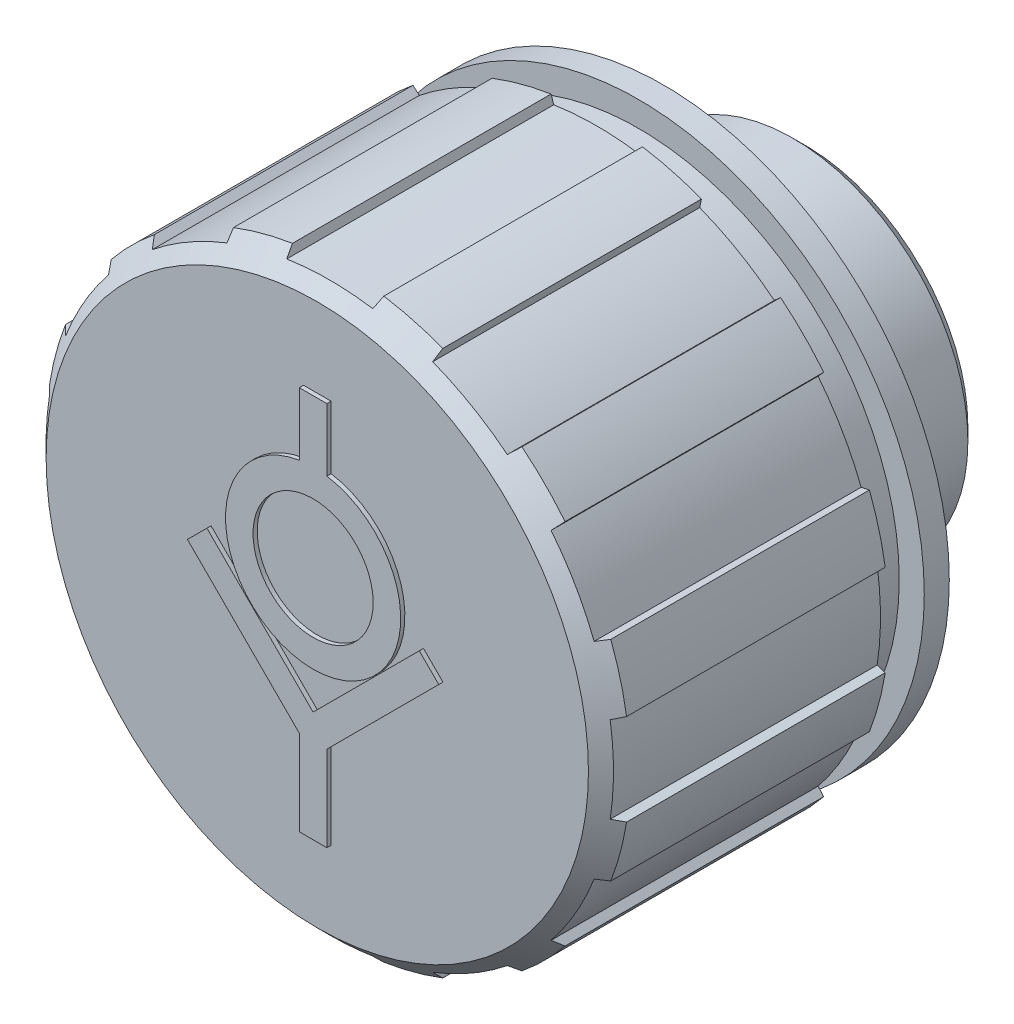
ISO-10303-21;
HEADER;
FILE_DESCRIPTION(('STEP AP214'),'2;1');
FILE_NAME('part.step','',(''),(''),'','','');
FILE_SCHEMA(('AUTOMOTIVE_DESIGN { 1 0 10303 214 1 1 1 1 }'));
ENDSEC;
DATA;
#1=APPLICATION_CONTEXT('core data for automotive mechanical design processes');
#2=APPLICATION_PROTOCOL_DEFINITION('international standard','automotive_design',2000,#1);
#3=PRODUCT_CONTEXT('',#1,'mechanical');
#4=PRODUCT('Part','Part','',(#3));
#5=PRODUCT_RELATED_PRODUCT_CATEGORY('part','',(#4));
#6=PRODUCT_DEFINITION_FORMATION('','',#4);
#7=PRODUCT_DEFINITION_CONTEXT('part definition',#1,'design');
#8=PRODUCT_DEFINITION('design','',#6,#7);
#9=PRODUCT_DEFINITION_SHAPE('','',#8);
#10=(LENGTH_UNIT() NAMED_UNIT(*) SI_UNIT(.MILLI.,.METRE.));
#11=(NAMED_UNIT(*) PLANE_ANGLE_UNIT() SI_UNIT($,.RADIAN.));
#12=(NAMED_UNIT(*) SI_UNIT($,.STERADIAN.) SOLID_ANGLE_UNIT());
#13=UNCERTAINTY_MEASURE_WITH_UNIT(LENGTH_MEASURE(1.E-05),#10,'distance_accuracy_value','');
#14=(GEOMETRIC_REPRESENTATION_CONTEXT(3) GLOBAL_UNCERTAINTY_ASSIGNED_CONTEXT((#13)) GLOBAL_UNIT_ASSIGNED_CONTEXT((#10,
#11,#12)) REPRESENTATION_CONTEXT('',''));
#15=CARTESIAN_POINT('',(0.,0.,0.));
#16=DIRECTION('',(0.,0.,1.));
#17=DIRECTION('',(1.,0.,0.));
#18=AXIS2_PLACEMENT_3D('',#15,#16,#17);
#19=CARTESIAN_POINT('',(-1.88539992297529E-13,0.,37.));
#20=DIRECTION('',(0.,0.,1.));
#21=DIRECTION('',(1.,0.,0.));
#22=AXIS2_PLACEMENT_3D('',#19,#20,#21);
#23=CYLINDRICAL_SURFACE('',#22,31.25);
#24=CARTESIAN_POINT('',(0.,0.,3.));
#25=DIRECTION('',(0.,0.,1.));
#26=DIRECTION('',(1.,0.,0.));
#27=AXIS2_PLACEMENT_3D('',#24,#25,#26);
#28=CIRCLE('',#27,31.25);
#29=CARTESIAN_POINT('',(31.2499999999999,0.,3.00000000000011));
#30=VERTEX_POINT('',#29);
#31=EDGE_CURVE('E10',#30,#30,#28,.T.);
#32=ORIENTED_EDGE('',*,*,#31,.T.);
#33=EDGE_LOOP('',(#32));
#34=FACE_BOUND('',#33,.T.);
#35=CARTESIAN_POINT('',(0.,0.,8.));
#36=DIRECTION('',(0.,0.,1.));
#37=DIRECTION('',(1.,0.,0.));
#38=AXIS2_PLACEMENT_3D('',#35,#36,#37);
#39=CIRCLE('',#38,31.25);
#40=CARTESIAN_POINT('',(31.2499999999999,0.,8.00000000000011));
#41=VERTEX_POINT('',#40);
#42=EDGE_CURVE('E19',#41,#41,#39,.F.);
#43=ORIENTED_EDGE('',*,*,#42,.T.);
#44=EDGE_LOOP('',(#43));
#45=FACE_BOUND('',#44,.T.);
#46=ADVANCED_FACE('F15',(#34,#45),#23,.T.);
#47=CARTESIAN_POINT('',(0.,0.,-6.));
#48=DIRECTION('',(0.,0.,1.));
#49=DIRECTION('',(1.,0.,0.));
#50=AXIS2_PLACEMENT_3D('',#47,#48,#49);
#51=PLANE('',#50);
#52=CARTESIAN_POINT('',(0.,0.,-6.));
#53=DIRECTION('',(0.,0.,1.));
#54=DIRECTION('',(1.,0.,0.));
#55=AXIS2_PLACEMENT_3D('',#52,#53,#54);
#56=CIRCLE('',#55,17.);
#57=CARTESIAN_POINT('',(17.,0.,-5.99999999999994));
#58=VERTEX_POINT('',#57);
#59=EDGE_CURVE('E949',#58,#58,#56,.F.);
#60=ORIENTED_EDGE('',*,*,#59,.T.);
#61=EDGE_LOOP('',(#60));
#62=FACE_BOUND('',#61,.T.);
#63=ADVANCED_FACE('F17',(#62),#51,.F.);
#64=CARTESIAN_POINT('',(-1.88539992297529E-13,0.,37.));
#65=DIRECTION('',(0.,0.,1.));
#66=DIRECTION('',(1.,0.,0.));
#67=AXIS2_PLACEMENT_3D('',#64,#65,#66);
#68=CYLINDRICAL_SURFACE('',#67,17.);
#69=ORIENTED_EDGE('',*,*,#59,.F.);
#70=EDGE_LOOP('',(#69));
#71=FACE_BOUND('',#70,.T.);
#72=CARTESIAN_POINT('',(0.,0.,-17.));
#73=DIRECTION('',(0.,0.,1.));
#74=DIRECTION('',(1.,0.,0.));
#75=AXIS2_PLACEMENT_3D('',#72,#73,#74);
#76=CIRCLE('',#75,17.);
#77=CARTESIAN_POINT('',(17.,0.,-16.9999999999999));
#78=VERTEX_POINT('',#77);
#79=EDGE_CURVE('E952',#78,#78,#76,.F.);
#80=ORIENTED_EDGE('',*,*,#79,.T.);
#81=EDGE_LOOP('',(#80));
#82=FACE_BOUND('',#81,.T.);
#83=ADVANCED_FACE('F935',(#71,#82),#68,.F.);
#84=CARTESIAN_POINT('',(0.,17.,-17.));
#85=DIRECTION('',(0.,0.,1.));
#86=DIRECTION('',(1.,0.,0.));
#87=AXIS2_PLACEMENT_3D('',#84,#85,#86);
#88=PLANE('',#87);
#89=ORIENTED_EDGE('',*,*,#79,.F.);
#90=EDGE_LOOP('',(#89));
#91=FACE_BOUND('',#90,.T.);
#92=CARTESIAN_POINT('',(0.,0.,-17.));
#93=DIRECTION('',(0.,0.,1.));
#94=DIRECTION('',(1.,0.,0.));
#95=AXIS2_PLACEMENT_3D('',#92,#93,#94);
#96=CIRCLE('',#95,19.476);
#97=CARTESIAN_POINT('',(19.476,0.,-16.9999999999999));
#98=VERTEX_POINT('',#97);
#99=EDGE_CURVE('E953',#98,#98,#96,.T.);
#100=ORIENTED_EDGE('',*,*,#99,.F.);
#101=EDGE_LOOP('',(#100));
#102=FACE_BOUND('',#101,.T.);
#103=ADVANCED_FACE('F932',(#91,#102),#88,.F.);
#104=CARTESIAN_POINT('',(0.,0.,-15.521));
#105=DIRECTION('',(0.,0.,1.));
#106=DIRECTION('',(1.,0.,0.));
#107=AXIS2_PLACEMENT_3D('',#104,#105,#106);
#108=CONICAL_SURFACE('',#107,20.955,0.785398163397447);
#109=ORIENTED_EDGE('',*,*,#99,.T.);
#110=EDGE_LOOP('',(#109));
#111=FACE_BOUND('',#110,.T.);
#112=CARTESIAN_POINT('',(0.,0.,-15.521));
#113=DIRECTION('',(0.,0.,1.));
#114=DIRECTION('',(1.,0.,0.));
#115=AXIS2_PLACEMENT_3D('',#112,#113,#114);
#116=CIRCLE('',#115,20.955);
#117=CARTESIAN_POINT('',(20.955,0.,-15.5209999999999));
#118=VERTEX_POINT('',#117);
#119=EDGE_CURVE('E956',#118,#118,#116,.T.);
#120=ORIENTED_EDGE('',*,*,#119,.F.);
#121=EDGE_LOOP('',(#120));
#122=FACE_BOUND('',#121,.T.);
#123=ADVANCED_FACE('F928',(#111,#122),#108,.T.);
#124=CARTESIAN_POINT('',(-1.88539992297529E-13,0.,37.));
#125=DIRECTION('',(0.,0.,1.));
#126=DIRECTION('',(1.,0.,0.));
#127=AXIS2_PLACEMENT_3D('',#124,#125,#126);
#128=CYLINDRICAL_SURFACE('',#127,20.955);
#129=ORIENTED_EDGE('',*,*,#119,.T.);
#130=EDGE_LOOP('',(#129));
#131=FACE_BOUND('',#130,.T.);
#132=CARTESIAN_POINT('',(0.,0.,-1.5));
#133=DIRECTION('',(0.,0.,1.));
#134=DIRECTION('',(1.,0.,0.));
#135=AXIS2_PLACEMENT_3D('',#132,#133,#134);
#136=CIRCLE('',#135,20.955);
#137=CARTESIAN_POINT('',(20.9549999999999,0.,-1.49999999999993));
#138=VERTEX_POINT('',#137);
#139=EDGE_CURVE('E967',#138,#138,#136,.F.);
#140=ORIENTED_EDGE('',*,*,#139,.T.);
#141=EDGE_LOOP('',(#140));
#142=FACE_BOUND('',#141,.T.);
#143=ADVANCED_FACE('F924',(#131,#142),#128,.T.);
#144=CARTESIAN_POINT('',(0.,20.955,-1.5));
#145=DIRECTION('',(0.,0.,1.));
#146=DIRECTION('',(1.,0.,0.));
#147=AXIS2_PLACEMENT_3D('',#144,#145,#146);
#148=PLANE('',#147);
#149=ORIENTED_EDGE('',*,*,#139,.F.);
#150=EDGE_LOOP('',(#149));
#151=FACE_BOUND('',#150,.T.);
#152=CARTESIAN_POINT('',(0.,0.,-1.5));
#153=DIRECTION('',(0.,0.,1.));
#154=DIRECTION('',(1.,0.,0.));
#155=AXIS2_PLACEMENT_3D('',#152,#153,#154);
#156=CIRCLE('',#155,23.705);
#157=CARTESIAN_POINT('',(23.7049999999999,0.,-1.49999999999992));
#158=VERTEX_POINT('',#157);
#159=EDGE_CURVE('E970',#158,#158,#156,.T.);
#160=ORIENTED_EDGE('',*,*,#159,.F.);
#161=EDGE_LOOP('',(#160));
#162=FACE_BOUND('',#161,.T.);
#163=ADVANCED_FACE('F920',(#151,#162),#148,.F.);
#164=CARTESIAN_POINT('',(-1.88539992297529E-13,0.,37.));
#165=DIRECTION('',(0.,0.,1.));
#166=DIRECTION('',(1.,0.,0.));
#167=AXIS2_PLACEMENT_3D('',#164,#165,#166);
#168=CYLINDRICAL_SURFACE('',#167,23.705);
#169=ORIENTED_EDGE('',*,*,#159,.T.);
#170=EDGE_LOOP('',(#169));
#171=FACE_BOUND('',#170,.T.);
#172=CARTESIAN_POINT('',(0.,0.,0.));
#173=DIRECTION('',(0.,0.,1.));
#174=DIRECTION('',(1.,0.,0.));
#175=AXIS2_PLACEMENT_3D('',#172,#173,#174);
#176=CIRCLE('',#175,23.705);
#177=CARTESIAN_POINT('',(23.7049999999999,0.,0.));
#178=VERTEX_POINT('',#177);
#179=EDGE_CURVE('E975',#178,#178,#176,.F.);
#180=ORIENTED_EDGE('',*,*,#179,.T.);
#181=EDGE_LOOP('',(#180));
#182=FACE_BOUND('',#181,.T.);
#183=ADVANCED_FACE('F916',(#171,#182),#168,.T.);
#184=CARTESIAN_POINT('',(0.,23.705,0.));
#185=DIRECTION('',(0.,0.,1.));
#186=DIRECTION('',(1.,0.,0.));
#187=AXIS2_PLACEMENT_3D('',#184,#185,#186);
#188=PLANE('',#187);
#189=ORIENTED_EDGE('',*,*,#179,.F.);
#190=EDGE_LOOP('',(#189));
#191=FACE_BOUND('',#190,.T.);
#192=CARTESIAN_POINT('',(0.,0.,0.));
#193=DIRECTION('',(0.,0.,1.));
#194=DIRECTION('',(1.,0.,0.));
#195=AXIS2_PLACEMENT_3D('',#192,#193,#194);
#196=CIRCLE('',#195,34.25);
#197=CARTESIAN_POINT('',(34.2499999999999,0.,1.19583235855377E-13));
#198=VERTEX_POINT('',#197);
#199=EDGE_CURVE('E980',#198,#198,#196,.T.);
#200=ORIENTED_EDGE('',*,*,#199,.F.);
#201=EDGE_LOOP('',(#200));
#202=FACE_BOUND('',#201,.T.);
#203=ADVANCED_FACE('F912',(#191,#202),#188,.F.);
#204=CARTESIAN_POINT('',(-1.88539992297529E-13,0.,37.));
#205=DIRECTION('',(0.,0.,1.));
#206=DIRECTION('',(1.,0.,0.));
#207=AXIS2_PLACEMENT_3D('',#204,#205,#206);
#208=CYLINDRICAL_SURFACE('',#207,34.25);
#209=ORIENTED_EDGE('',*,*,#199,.T.);
#210=EDGE_LOOP('',(#209));
#211=FACE_BOUND('',#210,.T.);
#212=CARTESIAN_POINT('',(0.,0.,3.));
#213=DIRECTION('',(0.,0.,1.));
#214=DIRECTION('',(1.,0.,0.));
#215=AXIS2_PLACEMENT_3D('',#212,#213,#214);
#216=CIRCLE('',#215,34.25);
#217=CARTESIAN_POINT('',(34.2499999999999,0.,3.00000000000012));
#218=VERTEX_POINT('',#217);
#219=EDGE_CURVE('E25',#218,#218,#216,.F.);
#220=ORIENTED_EDGE('',*,*,#219,.T.);
#221=EDGE_LOOP('',(#220));
#222=FACE_BOUND('',#221,.T.);
#223=ADVANCED_FACE('F908',(#211,#222),#208,.T.);
#224=CARTESIAN_POINT('',(0.,34.25,3.));
#225=DIRECTION('',(0.,0.,-1.));
#226=DIRECTION('',(-1.,0.,0.));
#227=AXIS2_PLACEMENT_3D('',#224,#225,#226);
#228=PLANE('',#227);
#229=ORIENTED_EDGE('',*,*,#219,.F.);
#230=EDGE_LOOP('',(#229));
#231=FACE_BOUND('',#230,.T.);
#232=ORIENTED_EDGE('',*,*,#31,.F.);
#233=EDGE_LOOP('',(#232));
#234=FACE_BOUND('',#233,.T.);
#235=ADVANCED_FACE('F901',(#231,#234),#228,.F.);
#236=CARTESIAN_POINT('',(-2.03351658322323E-13,5.1,41.5));
#237=DIRECTION('',(0.,0.,1.));
#238=DIRECTION('',(1.,0.,0.));
#239=AXIS2_PLACEMENT_3D('',#236,#237,#238);
#240=PLANE('',#239);
#241=CARTESIAN_POINT('',(-2.03351658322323E-13,5.1,41.5));
#242=DIRECTION('',(0.,0.,1.));
#243=DIRECTION('',(1.,0.,0.));
#244=AXIS2_PLACEMENT_3D('',#241,#242,#243);
#245=CIRCLE('',#244,7.2);
#246=CARTESIAN_POINT('',(7.1999999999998,5.1,41.5));
#247=VERTEX_POINT('',#246);
#248=EDGE_CURVE('E997',#247,#247,#245,.T.);
#249=ORIENTED_EDGE('',*,*,#248,.T.);
#250=EDGE_LOOP('',(#249));
#251=FACE_BOUND('',#250,.T.);
#252=ADVANCED_FACE('F897',(#251),#240,.T.);
#253=CARTESIAN_POINT('',(-2.03351658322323E-13,5.1,41.5));
#254=DIRECTION('',(0.,0.,1.));
#255=DIRECTION('',(1.,0.,0.));
#256=AXIS2_PLACEMENT_3D('',#253,#254,#255);
#257=CYLINDRICAL_SURFACE('',#256,7.2);
#258=CARTESIAN_POINT('',(-2.05097398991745E-13,5.1,42.));
#259=DIRECTION('',(0.,0.,1.));
#260=DIRECTION('',(1.,0.,0.));
#261=AXIS2_PLACEMENT_3D('',#258,#259,#260);
#262=CIRCLE('',#261,7.2);
#263=CARTESIAN_POINT('',(7.1999999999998,5.1,42.));
#264=VERTEX_POINT('',#263);
#265=EDGE_CURVE('E1000',#264,#264,#262,.F.);
#266=ORIENTED_EDGE('',*,*,#265,.F.);
#267=EDGE_LOOP('',(#266));
#268=FACE_BOUND('',#267,.T.);
#269=ORIENTED_EDGE('',*,*,#248,.F.);
#270=EDGE_LOOP('',(#269));
#271=FACE_BOUND('',#270,.T.);
#272=ADVANCED_FACE('F893',(#268,#271),#257,.F.);
#273=CARTESIAN_POINT('',(-2.16622580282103E-13,5.1,42.));
#274=DIRECTION('',(0.,0.,1.));
#275=DIRECTION('',(1.,0.,0.));
#276=AXIS2_PLACEMENT_3D('',#273,#274,#275);
#277=PLANE('',#276);
#278=DIRECTION('',(0.,1.,0.));
#279=VECTOR('',#278,1.);
#280=CARTESIAN_POINT('',(1.6499999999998,15.4695467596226,42.));
#281=LINE('',#280,#279);
#282=CARTESIAN_POINT('',(1.6499999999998,23.,42.));
#283=VERTEX_POINT('',#282);
#284=CARTESIAN_POINT('',(1.6499999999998,15.4695467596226,42.));
#285=VERTEX_POINT('',#284);
#286=EDGE_CURVE('E335',#283,#285,#281,.F.);
#287=ORIENTED_EDGE('',*,*,#286,.F.);
#288=DIRECTION('',(-1.,0.,0.));
#289=VECTOR('',#288,1.);
#290=CARTESIAN_POINT('',(1.6499999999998,23.,42.));
#291=LINE('',#290,#289);
#292=CARTESIAN_POINT('',(-1.6500000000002,23.,42.));
#293=VERTEX_POINT('',#292);
#294=EDGE_CURVE('E342',#293,#283,#291,.F.);
#295=ORIENTED_EDGE('',*,*,#294,.F.);
#296=DIRECTION('',(0.,1.,0.));
#297=VECTOR('',#296,1.);
#298=CARTESIAN_POINT('',(-1.6500000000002,23.,42.));
#299=LINE('',#298,#297);
#300=CARTESIAN_POINT('',(-1.6500000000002,15.4695467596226,42.));
#301=VERTEX_POINT('',#300);
#302=EDGE_CURVE('E502',#301,#293,#299,.T.);
#303=ORIENTED_EDGE('',*,*,#302,.F.);
#304=CARTESIAN_POINT('',(-2.16622580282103E-13,5.1,42.));
#305=DIRECTION('',(0.,0.,1.));
#306=DIRECTION('',(1.,0.,0.));
#307=AXIS2_PLACEMENT_3D('',#304,#305,#306);
#308=CIRCLE('',#307,10.5);
#309=EDGE_CURVE('E523',#285,#301,#308,.F.);
#310=ORIENTED_EDGE('',*,*,#309,.F.);
#311=EDGE_LOOP('',(#287,#295,#303,#310));
#312=FACE_BOUND('',#311,.T.);
#313=ORIENTED_EDGE('',*,*,#265,.T.);
#314=EDGE_LOOP('',(#313));
#315=FACE_BOUND('',#314,.T.);
#316=ADVANCED_FACE('F889',(#312,#315),#277,.T.);
#317=CARTESIAN_POINT('',(-2.05997398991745E-13,0.,42.));
#318=DIRECTION('',(0.,0.,-1.));
#319=DIRECTION('',(-1.,0.,0.));
#320=AXIS2_PLACEMENT_3D('',#317,#318,#319);
#321=PLANE('',#320);
#322=DIRECTION('',(0.7071087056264,-0.707104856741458,0.));
#323=VECTOR('',#322,1.);
#324=CARTESIAN_POINT('',(-15.0614,0.545227,42.));
#325=LINE('',#324,#323);
#326=CARTESIAN_POINT('',(-1.6500000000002,-12.8661,42.));
#327=VERTEX_POINT('',#326);
#328=CARTESIAN_POINT('',(-15.0614,0.545227,42.));
#329=VERTEX_POINT('',#328);
#330=EDGE_CURVE('E412',#327,#329,#325,.F.);
#331=ORIENTED_EDGE('',*,*,#330,.F.);
#332=DIRECTION('',(0.,-1.,0.));
#333=VECTOR('',#332,1.);
#334=CARTESIAN_POINT('',(-1.6500000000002,-12.8661,42.));
#335=LINE('',#334,#333);
#336=CARTESIAN_POINT('',(-1.6500000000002,-23.1,42.));
#337=VERTEX_POINT('',#336);
#338=EDGE_CURVE('E496',#337,#327,#335,.F.);
#339=ORIENTED_EDGE('',*,*,#338,.F.);
#340=DIRECTION('',(1.,0.,0.));
#341=VECTOR('',#340,1.);
#342=CARTESIAN_POINT('',(-1.6500000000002,-23.1,42.));
#343=LINE('',#342,#341);
#344=CARTESIAN_POINT('',(1.6499999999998,-23.1,42.));
#345=VERTEX_POINT('',#344);
#346=EDGE_CURVE('E494',#345,#337,#343,.F.);
#347=ORIENTED_EDGE('',*,*,#346,.F.);
#348=DIRECTION('',(0.,1.,0.));
#349=VECTOR('',#348,1.);
#350=CARTESIAN_POINT('',(1.6499999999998,-23.1,42.));
#351=LINE('',#350,#349);
#352=CARTESIAN_POINT('',(1.6499999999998,-12.8661,42.));
#353=VERTEX_POINT('',#352);
#354=EDGE_CURVE('E490',#353,#345,#351,.F.);
#355=ORIENTED_EDGE('',*,*,#354,.F.);
#356=DIRECTION('',(0.7071087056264,0.707104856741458,0.));
#357=VECTOR('',#356,1.);
#358=CARTESIAN_POINT('',(1.6499999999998,-12.8661,42.));
#359=LINE('',#358,#357);
#360=CARTESIAN_POINT('',(15.0614,0.545227,42.));
#361=VERTEX_POINT('',#360);
#362=EDGE_CURVE('E486',#361,#353,#359,.F.);
#363=ORIENTED_EDGE('',*,*,#362,.F.);
#364=DIRECTION('',(-0.707113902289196,0.707099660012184,0.));
#365=VECTOR('',#364,1.);
#366=CARTESIAN_POINT('',(15.0614,0.545227,42.));
#367=LINE('',#366,#365);
#368=CARTESIAN_POINT('',(12.7278999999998,2.87868,42.));
#369=VERTEX_POINT('',#368);
#370=EDGE_CURVE('E482',#369,#361,#367,.F.);
#371=ORIENTED_EDGE('',*,*,#370,.F.);
#372=DIRECTION('',(-0.707106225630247,-0.707107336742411,0.));
#373=VECTOR('',#372,1.);
#374=CARTESIAN_POINT('',(12.7278999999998,2.87868,42.));
#375=LINE('',#374,#373);
#376=CARTESIAN_POINT('',(-2.07388212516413E-13,-9.84924,42.));
#377=VERTEX_POINT('',#376);
#378=EDGE_CURVE('E478',#377,#369,#375,.F.);
#379=ORIENTED_EDGE('',*,*,#378,.F.);
#380=DIRECTION('',(-0.707106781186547,0.707106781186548,0.));
#381=VECTOR('',#380,1.);
#382=CARTESIAN_POINT('',(-2.07773755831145E-13,-9.84924,42.));
#383=LINE('',#382,#381);
#384=CARTESIAN_POINT('',(-12.7279100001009,2.87867000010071,42.));
#385=VERTEX_POINT('',#384);
#386=EDGE_CURVE('E474',#385,#377,#383,.F.);
#387=ORIENTED_EDGE('',*,*,#386,.F.);
#388=DIRECTION('',(-0.707113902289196,-0.707099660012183,0.));
#389=VECTOR('',#388,1.);
#390=CARTESIAN_POINT('',(-12.7279100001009,2.87867000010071,42.));
#391=LINE('',#390,#389);
#392=EDGE_CURVE('E470',#329,#385,#391,.F.);
#393=ORIENTED_EDGE('',*,*,#392,.F.);
#394=EDGE_LOOP('',(#331,#339,#347,#355,#363,#371,#379,#387,#393));
#395=FACE_BOUND('',#394,.T.);
#396=ADVANCED_FACE('F885',(#395),#321,.F.);
#397=CARTESIAN_POINT('',(-2.14873348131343E-13,5.1,41.499));
#398=DIRECTION('',(0.,0.,1.));
#399=DIRECTION('',(1.,0.,0.));
#400=AXIS2_PLACEMENT_3D('',#397,#398,#399);
#401=CYLINDRICAL_SURFACE('',#400,10.5);
#402=ORIENTED_EDGE('',*,*,#309,.T.);
#403=DIRECTION('',(0.,0.,1.));
#404=VECTOR('',#403,1.);
#405=CARTESIAN_POINT('',(-1.6500000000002,15.4695467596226,41.499));
#406=LINE('',#405,#404);
#407=CARTESIAN_POINT('',(-1.6500000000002,15.4695467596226,41.5));
#408=VERTEX_POINT('',#407);
#409=EDGE_CURVE('E499',#408,#301,#406,.T.);
#410=ORIENTED_EDGE('',*,*,#409,.F.);
#411=CARTESIAN_POINT('',(-2.14876839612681E-13,5.1,41.5));
#412=DIRECTION('',(0.,0.,1.));
#413=DIRECTION('',(1.,0.,0.));
#414=AXIS2_PLACEMENT_3D('',#411,#412,#413);
#415=CIRCLE('',#414,10.5);
#416=CARTESIAN_POINT('',(1.64999999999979,15.4695467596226,41.5));
#417=VERTEX_POINT('',#416);
#418=EDGE_CURVE('E416',#408,#417,#415,.T.);
#419=ORIENTED_EDGE('',*,*,#418,.T.);
#420=DIRECTION('',(0.,0.,-1.));
#421=VECTOR('',#420,1.);
#422=CARTESIAN_POINT('',(1.6499999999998,15.4695467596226,41.499));
#423=LINE('',#422,#421);
#424=EDGE_CURVE('E514',#285,#417,#423,.T.);
#425=ORIENTED_EDGE('',*,*,#424,.F.);
#426=EDGE_LOOP('',(#402,#410,#419,#425));
#427=FACE_BOUND('',#426,.T.);
#428=ADVANCED_FACE('F882',(#427),#401,.T.);
#429=CARTESIAN_POINT('',(1.6499999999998,15.4695467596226,41.499));
#430=DIRECTION('',(1.,0.,0.));
#431=DIRECTION('',(0.,0.,-1.));
#432=AXIS2_PLACEMENT_3D('',#429,#430,#431);
#433=PLANE('',#432);
#434=ORIENTED_EDGE('',*,*,#286,.T.);
#435=ORIENTED_EDGE('',*,*,#424,.T.);
#436=DIRECTION('',(0.,1.,0.));
#437=VECTOR('',#436,1.);
#438=CARTESIAN_POINT('',(1.64999999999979,32.5,41.5));
#439=LINE('',#438,#437);
#440=CARTESIAN_POINT('',(1.64999999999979,23.,41.5));
#441=VERTEX_POINT('',#440);
#442=EDGE_CURVE('E461',#417,#441,#439,.T.);
#443=ORIENTED_EDGE('',*,*,#442,.T.);
#444=DIRECTION('',(0.,0.,1.));
#445=VECTOR('',#444,1.);
#446=CARTESIAN_POINT('',(1.6499999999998,23.,41.499));
#447=LINE('',#446,#445);
#448=EDGE_CURVE('E503',#283,#441,#447,.F.);
#449=ORIENTED_EDGE('',*,*,#448,.F.);
#450=EDGE_LOOP('',(#434,#435,#443,#449));
#451=FACE_BOUND('',#450,.T.);
#452=ADVANCED_FACE('F879',(#451),#433,.T.);
#453=CARTESIAN_POINT('',(1.6499999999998,23.,41.499));
#454=DIRECTION('',(0.,1.,0.));
#455=DIRECTION('',(-1.,0.,0.));
#456=AXIS2_PLACEMENT_3D('',#453,#454,#455);
#457=PLANE('',#456);
#458=ORIENTED_EDGE('',*,*,#294,.T.);
#459=ORIENTED_EDGE('',*,*,#448,.T.);
#460=DIRECTION('',(-1.,0.,0.));
#461=VECTOR('',#460,1.);
#462=CARTESIAN_POINT('',(-2.04251658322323E-13,23.,41.5));
#463=LINE('',#462,#461);
#464=CARTESIAN_POINT('',(-1.6500000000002,23.,41.5));
#465=VERTEX_POINT('',#464);
#466=EDGE_CURVE('E458',#441,#465,#463,.T.);
#467=ORIENTED_EDGE('',*,*,#466,.T.);
#468=DIRECTION('',(0.,0.,1.));
#469=VECTOR('',#468,1.);
#470=CARTESIAN_POINT('',(-1.6500000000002,23.,41.499));
#471=LINE('',#470,#469);
#472=EDGE_CURVE('E498',#293,#465,#471,.F.);
#473=ORIENTED_EDGE('',*,*,#472,.F.);
#474=EDGE_LOOP('',(#458,#459,#467,#473));
#475=FACE_BOUND('',#474,.T.);
#476=ADVANCED_FACE('F875',(#475),#457,.T.);
#477=CARTESIAN_POINT('',(-1.6500000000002,23.,41.499));
#478=DIRECTION('',(-1.,0.,0.));
#479=DIRECTION('',(0.,0.,1.));
#480=AXIS2_PLACEMENT_3D('',#477,#478,#479);
#481=PLANE('',#480);
#482=ORIENTED_EDGE('',*,*,#302,.T.);
#483=ORIENTED_EDGE('',*,*,#472,.T.);
#484=DIRECTION('',(0.,1.,0.));
#485=VECTOR('',#484,1.);
#486=CARTESIAN_POINT('',(-1.6500000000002,32.5,41.5));
#487=LINE('',#486,#485);
#488=EDGE_CURVE('E455',#465,#408,#487,.F.);
#489=ORIENTED_EDGE('',*,*,#488,.T.);
#490=ORIENTED_EDGE('',*,*,#409,.T.);
#491=EDGE_LOOP('',(#482,#483,#489,#490));
#492=FACE_BOUND('',#491,.T.);
#493=ADVANCED_FACE('F871',(#492),#481,.T.);
#494=CARTESIAN_POINT('',(-1.6500000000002,-12.8661,41.499));
#495=DIRECTION('',(-1.,0.,0.));
#496=DIRECTION('',(0.,-1.,0.));
#497=AXIS2_PLACEMENT_3D('',#494,#495,#496);
#498=PLANE('',#497);
#499=ORIENTED_EDGE('',*,*,#338,.T.);
#500=DIRECTION('',(0.,0.,1.));
#501=VECTOR('',#500,1.);
#502=CARTESIAN_POINT('',(-1.6500000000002,-12.8661,41.499));
#503=LINE('',#502,#501);
#504=CARTESIAN_POINT('',(-1.6500000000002,-12.8661,41.5));
#505=VERTEX_POINT('',#504);
#506=EDGE_CURVE('E467',#505,#327,#503,.T.);
#507=ORIENTED_EDGE('',*,*,#506,.F.);
#508=DIRECTION('',(0.,1.,0.));
#509=VECTOR('',#508,1.);
#510=CARTESIAN_POINT('',(-1.6500000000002,32.5,41.5));
#511=LINE('',#510,#509);
#512=CARTESIAN_POINT('',(-1.6500000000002,-23.1,41.5));
#513=VERTEX_POINT('',#512);
#514=EDGE_CURVE('E427',#505,#513,#511,.F.);
#515=ORIENTED_EDGE('',*,*,#514,.T.);
#516=DIRECTION('',(0.,0.,1.));
#517=VECTOR('',#516,1.);
#518=CARTESIAN_POINT('',(-1.6500000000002,-23.1,41.499));
#519=LINE('',#518,#517);
#520=EDGE_CURVE('E492',#337,#513,#519,.F.);
#521=ORIENTED_EDGE('',*,*,#520,.F.);
#522=EDGE_LOOP('',(#499,#507,#515,#521));
#523=FACE_BOUND('',#522,.T.);
#524=ADVANCED_FACE('F867',(#523),#498,.T.);
#525=CARTESIAN_POINT('',(-1.6500000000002,-23.1,41.499));
#526=DIRECTION('',(0.,-1.,0.));
#527=DIRECTION('',(1.,0.,0.));
#528=AXIS2_PLACEMENT_3D('',#525,#526,#527);
#529=PLANE('',#528);
#530=ORIENTED_EDGE('',*,*,#346,.T.);
#531=ORIENTED_EDGE('',*,*,#520,.T.);
#532=DIRECTION('',(-1.,0.,0.));
#533=VECTOR('',#532,1.);
#534=CARTESIAN_POINT('',(-2.04251658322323E-13,-23.1,41.5));
#535=LINE('',#534,#533);
#536=CARTESIAN_POINT('',(1.6499999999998,-23.1,41.5));
#537=VERTEX_POINT('',#536);
#538=EDGE_CURVE('E451',#513,#537,#535,.F.);
#539=ORIENTED_EDGE('',*,*,#538,.T.);
#540=DIRECTION('',(0.,0.,-1.));
#541=VECTOR('',#540,1.);
#542=CARTESIAN_POINT('',(1.6499999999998,-23.1,41.499));
#543=LINE('',#542,#541);
#544=EDGE_CURVE('E488',#345,#537,#543,.T.);
#545=ORIENTED_EDGE('',*,*,#544,.F.);
#546=EDGE_LOOP('',(#530,#531,#539,#545));
#547=FACE_BOUND('',#546,.T.);
#548=ADVANCED_FACE('F863',(#547),#529,.T.);
#549=CARTESIAN_POINT('',(1.6499999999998,-23.1,41.499));
#550=DIRECTION('',(1.,0.,0.));
#551=DIRECTION('',(0.,0.,-1.));
#552=AXIS2_PLACEMENT_3D('',#549,#550,#551);
#553=PLANE('',#552);
#554=ORIENTED_EDGE('',*,*,#354,.T.);
#555=ORIENTED_EDGE('',*,*,#544,.T.);
#556=DIRECTION('',(0.,1.,0.));
#557=VECTOR('',#556,1.);
#558=CARTESIAN_POINT('',(1.6499999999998,32.5,41.5));
#559=LINE('',#558,#557);
#560=CARTESIAN_POINT('',(1.6499999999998,-12.8661,41.5));
#561=VERTEX_POINT('',#560);
#562=EDGE_CURVE('E448',#537,#561,#559,.T.);
#563=ORIENTED_EDGE('',*,*,#562,.T.);
#564=DIRECTION('',(0.,0.,1.));
#565=VECTOR('',#564,1.);
#566=CARTESIAN_POINT('',(1.6499999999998,-12.8661,41.499));
#567=LINE('',#566,#565);
#568=EDGE_CURVE('E484',#353,#561,#567,.F.);
#569=ORIENTED_EDGE('',*,*,#568,.F.);
#570=EDGE_LOOP('',(#554,#555,#563,#569));
#571=FACE_BOUND('',#570,.T.);
#572=ADVANCED_FACE('F859',(#571),#553,.T.);
#573=CARTESIAN_POINT('',(1.6499999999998,-12.8661,41.499));
#574=DIRECTION('',(0.707104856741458,-0.7071087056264,0.));
#575=DIRECTION('',(0.7071087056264,0.707104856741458,0.));
#576=AXIS2_PLACEMENT_3D('',#573,#574,#575);
#577=PLANE('',#576);
#578=ORIENTED_EDGE('',*,*,#362,.T.);
#579=ORIENTED_EDGE('',*,*,#568,.T.);
#580=DIRECTION('',(0.7071087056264,0.707104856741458,0.));
#581=VECTOR('',#580,1.);
#582=CARTESIAN_POINT('',(1.6499999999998,-12.8661,41.5));
#583=LINE('',#582,#581);
#584=CARTESIAN_POINT('',(15.0614,0.545227,41.5));
#585=VERTEX_POINT('',#584);
#586=EDGE_CURVE('E445',#561,#585,#583,.T.);
#587=ORIENTED_EDGE('',*,*,#586,.T.);
#588=DIRECTION('',(0.,0.,1.));
#589=VECTOR('',#588,1.);
#590=CARTESIAN_POINT('',(15.0614,0.545227,41.499));
#591=LINE('',#590,#589);
#592=EDGE_CURVE('E480',#361,#585,#591,.F.);
#593=ORIENTED_EDGE('',*,*,#592,.F.);
#594=EDGE_LOOP('',(#578,#579,#587,#593));
#595=FACE_BOUND('',#594,.T.);
#596=ADVANCED_FACE('F855',(#595),#577,.T.);
#597=CARTESIAN_POINT('',(15.0614,0.545227,41.499));
#598=DIRECTION('',(0.707099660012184,0.707113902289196,0.));
#599=DIRECTION('',(-0.707113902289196,0.707099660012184,0.));
#600=AXIS2_PLACEMENT_3D('',#597,#598,#599);
#601=PLANE('',#600);
#602=ORIENTED_EDGE('',*,*,#370,.T.);
#603=ORIENTED_EDGE('',*,*,#592,.T.);
#604=DIRECTION('',(-0.707113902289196,0.707099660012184,0.));
#605=VECTOR('',#604,1.);
#606=CARTESIAN_POINT('',(15.0614,0.545227,41.5));
#607=LINE('',#606,#605);
#608=CARTESIAN_POINT('',(12.7278999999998,2.87868,41.5));
#609=VERTEX_POINT('',#608);
#610=EDGE_CURVE('E442',#585,#609,#607,.T.);
#611=ORIENTED_EDGE('',*,*,#610,.T.);
#612=DIRECTION('',(0.,0.,1.));
#613=VECTOR('',#612,1.);
#614=CARTESIAN_POINT('',(12.7278999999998,2.87868,41.499));
#615=LINE('',#614,#613);
#616=EDGE_CURVE('E476',#369,#609,#615,.F.);
#617=ORIENTED_EDGE('',*,*,#616,.F.);
#618=EDGE_LOOP('',(#602,#603,#611,#617));
#619=FACE_BOUND('',#618,.T.);
#620=ADVANCED_FACE('F851',(#619),#601,.T.);
#621=CARTESIAN_POINT('',(12.7278999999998,2.87868,41.499));
#622=DIRECTION('',(-0.707107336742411,0.707106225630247,0.));
#623=DIRECTION('',(-0.707106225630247,-0.707107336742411,0.));
#624=AXIS2_PLACEMENT_3D('',#621,#622,#623);
#625=PLANE('',#624);
#626=ORIENTED_EDGE('',*,*,#378,.T.);
#627=ORIENTED_EDGE('',*,*,#616,.T.);
#628=DIRECTION('',(-0.707106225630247,-0.707107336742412,0.));
#629=VECTOR('',#628,1.);
#630=CARTESIAN_POINT('',(12.7278999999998,2.87868,41.5));
#631=LINE('',#630,#629);
#632=CARTESIAN_POINT('',(-2.03474068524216E-13,-9.84924,41.5));
#633=VERTEX_POINT('',#632);
#634=EDGE_CURVE('E436',#609,#633,#631,.T.);
#635=ORIENTED_EDGE('',*,*,#634,.T.);
#636=DIRECTION('',(0.,0.,1.));
#637=VECTOR('',#636,1.);
#638=CARTESIAN_POINT('',(-2.04713072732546E-13,-9.84924,41.499));
#639=LINE('',#638,#637);
#640=EDGE_CURVE('E472',#377,#633,#639,.F.);
#641=ORIENTED_EDGE('',*,*,#640,.F.);
#642=EDGE_LOOP('',(#626,#627,#635,#641));
#643=FACE_BOUND('',#642,.T.);
#644=ADVANCED_FACE('F847',(#643),#625,.T.);
#645=CARTESIAN_POINT('',(-2.06024523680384E-13,-9.84924,41.499));
#646=DIRECTION('',(0.707106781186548,0.707106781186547,0.));
#647=DIRECTION('',(-0.707106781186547,0.707106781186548,0.));
#648=AXIS2_PLACEMENT_3D('',#645,#646,#647);
#649=PLANE('',#648);
#650=ORIENTED_EDGE('',*,*,#386,.T.);
#651=ORIENTED_EDGE('',*,*,#640,.T.);
#652=DIRECTION('',(-0.707106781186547,0.707106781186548,0.));
#653=VECTOR('',#652,1.);
#654=CARTESIAN_POINT('',(-2.00782211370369E-13,-9.84924,41.5));
#655=LINE('',#654,#653);
#656=CARTESIAN_POINT('',(-12.7279100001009,2.87867000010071,41.5));
#657=VERTEX_POINT('',#656);
#658=EDGE_CURVE('E434',#633,#657,#655,.T.);
#659=ORIENTED_EDGE('',*,*,#658,.T.);
#660=DIRECTION('',(0.,0.,1.));
#661=VECTOR('',#660,1.);
#662=CARTESIAN_POINT('',(-12.7279100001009,2.87867000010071,41.499));
#663=LINE('',#662,#661);
#664=EDGE_CURVE('E433',#385,#657,#663,.F.);
#665=ORIENTED_EDGE('',*,*,#664,.F.);
#666=EDGE_LOOP('',(#650,#651,#659,#665));
#667=FACE_BOUND('',#666,.T.);
#668=ADVANCED_FACE('F844',(#667),#649,.T.);
#669=CARTESIAN_POINT('',(-12.7279100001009,2.87867000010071,41.499));
#670=DIRECTION('',(-0.707099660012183,0.707113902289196,0.));
#671=DIRECTION('',(-0.707113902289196,-0.707099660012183,0.));
#672=AXIS2_PLACEMENT_3D('',#669,#670,#671);
#673=PLANE('',#672);
#674=ORIENTED_EDGE('',*,*,#392,.T.);
#675=ORIENTED_EDGE('',*,*,#664,.T.);
#676=DIRECTION('',(-0.707113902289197,-0.707099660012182,0.));
#677=VECTOR('',#676,1.);
#678=CARTESIAN_POINT('',(-12.7279100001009,2.87867000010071,41.5));
#679=LINE('',#678,#677);
#680=CARTESIAN_POINT('',(-15.0614,0.545227,41.5));
#681=VERTEX_POINT('',#680);
#682=EDGE_CURVE('E423',#657,#681,#679,.T.);
#683=ORIENTED_EDGE('',*,*,#682,.T.);
#684=DIRECTION('',(0.,0.,1.));
#685=VECTOR('',#684,1.);
#686=CARTESIAN_POINT('',(-15.0614,0.545227,41.499));
#687=LINE('',#686,#685);
#688=EDGE_CURVE('E406',#329,#681,#687,.F.);
#689=ORIENTED_EDGE('',*,*,#688,.F.);
#690=EDGE_LOOP('',(#674,#675,#683,#689));
#691=FACE_BOUND('',#690,.T.);
#692=ADVANCED_FACE('F431',(#691),#673,.T.);
#693=CARTESIAN_POINT('',(-15.0614,0.545227,41.499));
#694=DIRECTION('',(-0.707104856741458,-0.7071087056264,0.));
#695=DIRECTION('',(0.7071087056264,-0.707104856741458,0.));
#696=AXIS2_PLACEMENT_3D('',#693,#694,#695);
#697=PLANE('',#696);
#698=ORIENTED_EDGE('',*,*,#330,.T.);
#699=ORIENTED_EDGE('',*,*,#688,.T.);
#700=DIRECTION('',(0.7071087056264,-0.707104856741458,0.));
#701=VECTOR('',#700,1.);
#702=CARTESIAN_POINT('',(-15.0614,0.545227,41.5));
#703=LINE('',#702,#701);
#704=EDGE_CURVE('E410',#681,#505,#703,.T.);
#705=ORIENTED_EDGE('',*,*,#704,.T.);
#706=ORIENTED_EDGE('',*,*,#506,.T.);
#707=EDGE_LOOP('',(#698,#699,#705,#706));
#708=FACE_BOUND('',#707,.T.);
#709=ADVANCED_FACE('F408',(#708),#697,.T.);
#710=CARTESIAN_POINT('',(-2.04251658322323E-13,32.5,41.5));
#711=DIRECTION('',(0.,0.,-1.));
#712=DIRECTION('',(-1.,0.,0.));
#713=AXIS2_PLACEMENT_3D('',#710,#711,#712);
#714=PLANE('',#713);
#715=CARTESIAN_POINT('',(-2.04251658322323E-13,0.,41.5));
#716=DIRECTION('',(0.,0.,-1.));
#717=DIRECTION('',(0.,-1.,0.));
#718=AXIS2_PLACEMENT_3D('',#715,#716,#717);
#719=CIRCLE('',#718,32.5);
#720=CARTESIAN_POINT('',(-2.04251658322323E-13,-32.5,41.5));
#721=VERTEX_POINT('',#720);
#722=EDGE_CURVE('E1009',#721,#721,#719,.T.);
#723=ORIENTED_EDGE('',*,*,#722,.F.);
#724=EDGE_LOOP('',(#723));
#725=FACE_BOUND('',#724,.T.);
#726=ORIENTED_EDGE('',*,*,#682,.F.);
#727=ORIENTED_EDGE('',*,*,#658,.F.);
#728=ORIENTED_EDGE('',*,*,#634,.F.);
#729=ORIENTED_EDGE('',*,*,#610,.F.);
#730=ORIENTED_EDGE('',*,*,#586,.F.);
#731=ORIENTED_EDGE('',*,*,#562,.F.);
#732=ORIENTED_EDGE('',*,*,#538,.F.);
#733=ORIENTED_EDGE('',*,*,#514,.F.);
#734=ORIENTED_EDGE('',*,*,#704,.F.);
#735=EDGE_LOOP('',(#726,#727,#728,#729,#730,#731,#732,#733,#734));
#736=FACE_BOUND('',#735,.T.);
#737=ORIENTED_EDGE('',*,*,#466,.F.);
#738=ORIENTED_EDGE('',*,*,#442,.F.);
#739=ORIENTED_EDGE('',*,*,#418,.F.);
#740=ORIENTED_EDGE('',*,*,#488,.F.);
#741=EDGE_LOOP('',(#737,#738,#739,#740));
#742=FACE_BOUND('',#741,.T.);
#743=ADVANCED_FACE('F420',(#725,#736,#742),#714,.F.);
#744=CARTESIAN_POINT('',(-12.5428782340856,32.6753149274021,7.));
#745=DIRECTION('',(-0.978147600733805,-0.20791169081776,0.));
#746=DIRECTION('',(0.20791169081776,-0.978147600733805,0.));
#747=AXIS2_PLACEMENT_3D('',#744,#745,#746);
#748=PLANE('',#747);
#749=CARTESIAN_POINT('',(-12.5428782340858,32.6753149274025,38.9999999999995));
#750=CARTESIAN_POINT('',(-12.507787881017,32.5102277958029,39.1666982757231));
#751=CARTESIAN_POINT('',(-12.472694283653,32.3451254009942,39.3333807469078));
#752=CARTESIAN_POINT('',(-12.4025006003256,32.014890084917,39.6667140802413));
#753=CARTESIAN_POINT('',(-12.3674005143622,31.8497571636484,39.8333649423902));
#754=CARTESIAN_POINT('',(-12.3322971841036,31.6846089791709,40.));
#755=B_SPLINE_CURVE_WITH_KNOTS('',3,(#749,#750,#751,#752,#753,#754),.UNSPECIFIED.,.F.,.F.,(4,2,
4),(0.,0.711660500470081,1.42332100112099),.UNSPECIFIED.);
#756=CARTESIAN_POINT('',(-12.5428782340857,32.6753149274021,38.9999999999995));
#757=VERTEX_POINT('',#756);
#758=CARTESIAN_POINT('',(-12.3322971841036,31.6846089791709,40.));
#759=VERTEX_POINT('',#758);
#760=EDGE_CURVE('E666',#757,#759,#755,.T.);
#761=ORIENTED_EDGE('',*,*,#760,.F.);
#762=DIRECTION('',(0.,0.,1.));
#763=VECTOR('',#762,1.);
#764=CARTESIAN_POINT('',(-12.5428782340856,32.6753149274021,7.));
#765=LINE('',#764,#763);
#766=CARTESIAN_POINT('',(-12.5428782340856,32.6753149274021,8.));
#767=VERTEX_POINT('',#766);
#768=EDGE_CURVE('E607',#767,#757,#765,.T.);
#769=ORIENTED_EDGE('',*,*,#768,.F.);
#770=DIRECTION('',(0.20791169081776,-0.978147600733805,0.));
#771=VECTOR('',#770,1.);
#772=CARTESIAN_POINT('',(-12.5428782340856,32.6753149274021,8.));
#773=LINE('',#772,#771);
#774=CARTESIAN_POINT('',(-12.3322971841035,31.6846089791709,8.));
#775=VERTEX_POINT('',#774);
#776=EDGE_CURVE('E429',#767,#775,#773,.T.);
#777=ORIENTED_EDGE('',*,*,#776,.T.);
#778=DIRECTION('',(0.,0.,1.));
#779=VECTOR('',#778,1.);
#780=CARTESIAN_POINT('',(-12.3322971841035,31.6846089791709,7.));
#781=LINE('',#780,#779);
#782=EDGE_CURVE('E1171',#759,#775,#781,.F.);
#783=ORIENTED_EDGE('',*,*,#782,.F.);
#784=EDGE_LOOP('',(#761,#769,#777,#783));
#785=FACE_BOUND('',#784,.T.);
#786=ADVANCED_FACE('F831',(#785),#748,.T.);
#787=CARTESIAN_POINT('',(-21.2735276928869,26.5223871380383,7.));
#788=DIRECTION('',(0.669130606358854,0.743144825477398,0.));
#789=DIRECTION('',(-0.743144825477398,0.669130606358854,0.));
#790=AXIS2_PLACEMENT_3D('',#787,#788,#789);
#791=PLANE('',#790);
#792=CARTESIAN_POINT('',(-21.273527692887,26.5223871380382,40.));
#793=CARTESIAN_POINT('',(-21.3989985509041,26.6353616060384,39.8333649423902));
#794=CARTESIAN_POINT('',(-21.524457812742,26.7483256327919,39.6667140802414));
#795=CARTESIAN_POINT('',(-21.7753531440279,26.9742328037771,39.3333807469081));
#796=CARTESIAN_POINT('',(-21.9007892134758,27.0871759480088,39.1666982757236));
#797=CARTESIAN_POINT('',(-22.0262136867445,27.200108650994,39.));
#798=B_SPLINE_CURVE_WITH_KNOTS('',3,(#792,#793,#794,#795,#796,#797),.UNSPECIFIED.,.F.,.F.,(4,2,
4),(0.,0.711660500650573,1.42332100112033),.UNSPECIFIED.);
#799=CARTESIAN_POINT('',(-21.273527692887,26.5223871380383,40.));
#800=VERTEX_POINT('',#799);
#801=CARTESIAN_POINT('',(-22.0262136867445,27.200108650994,39.));
#802=VERTEX_POINT('',#801);
#803=EDGE_CURVE('E658',#800,#802,#798,.T.);
#804=ORIENTED_EDGE('',*,*,#803,.F.);
#805=DIRECTION('',(0.,0.,1.));
#806=VECTOR('',#805,1.);
#807=CARTESIAN_POINT('',(-21.2735276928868,26.5223871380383,7.));
#808=LINE('',#807,#806);
#809=CARTESIAN_POINT('',(-21.2735276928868,26.5223871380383,8.));
#810=VERTEX_POINT('',#809);
#811=EDGE_CURVE('E1172',#810,#800,#808,.T.);
#812=ORIENTED_EDGE('',*,*,#811,.F.);
#813=DIRECTION('',(-0.743144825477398,0.669130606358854,0.));
#814=VECTOR('',#813,1.);
#815=CARTESIAN_POINT('',(-21.2735276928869,26.5223871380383,8.));
#816=LINE('',#815,#814);
#817=CARTESIAN_POINT('',(-22.0262136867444,27.200108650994,8.));
#818=VERTEX_POINT('',#817);
#819=EDGE_CURVE('E1156',#810,#818,#816,.T.);
#820=ORIENTED_EDGE('',*,*,#819,.T.);
#821=DIRECTION('',(0.,0.,1.));
#822=VECTOR('',#821,1.);
#823=CARTESIAN_POINT('',(-22.0262136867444,27.200108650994,6.99999999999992));
#824=LINE('',#823,#822);
#825=EDGE_CURVE('E1166',#802,#818,#824,.F.);
#826=ORIENTED_EDGE('',*,*,#825,.F.);
#827=EDGE_LOOP('',(#804,#812,#820,#826));
#828=FACE_BOUND('',#827,.T.);
#829=ADVANCED_FACE('F827',(#828),#791,.T.);
#830=CARTESIAN_POINT('',(-27.2001086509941,22.0262136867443,6.99999999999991));
#831=DIRECTION('',(-0.743144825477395,-0.669130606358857,0.));
#832=DIRECTION('',(0.669130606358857,-0.743144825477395,0.));
#833=AXIS2_PLACEMENT_3D('',#830,#831,#832);
#834=PLANE('',#833);
#835=CARTESIAN_POINT('',(-27.2001086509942,22.0262136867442,39.));
#836=CARTESIAN_POINT('',(-27.087175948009,21.9007892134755,39.1666982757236));
#837=CARTESIAN_POINT('',(-26.9742328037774,21.7753531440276,39.3333807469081));
#838=CARTESIAN_POINT('',(-26.7483256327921,21.5244578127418,39.6667140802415));
#839=CARTESIAN_POINT('',(-26.6353616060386,21.3989985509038,39.8333649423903));
#840=CARTESIAN_POINT('',(-26.5223871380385,21.2735276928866,40.));
#841=B_SPLINE_CURVE_WITH_KNOTS('',3,(#835,#836,#837,#838,#839,#840),.UNSPECIFIED.,.F.,.F.,(4,2,
4),(0.,0.711660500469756,1.42332100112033),.UNSPECIFIED.);
#842=CARTESIAN_POINT('',(-27.2001086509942,22.0262136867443,39.));
#843=VERTEX_POINT('',#842);
#844=CARTESIAN_POINT('',(-26.5223871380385,21.2735276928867,40.));
#845=VERTEX_POINT('',#844);
#846=EDGE_CURVE('E650',#843,#845,#841,.T.);
#847=ORIENTED_EDGE('',*,*,#846,.F.);
#848=DIRECTION('',(0.,0.,1.));
#849=VECTOR('',#848,1.);
#850=CARTESIAN_POINT('',(-27.2001086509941,22.0262136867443,6.99999999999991));
#851=LINE('',#850,#849);
#852=CARTESIAN_POINT('',(-27.2001086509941,22.0262136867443,7.99999999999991));
#853=VERTEX_POINT('',#852);
#854=EDGE_CURVE('E1167',#853,#843,#851,.T.);
#855=ORIENTED_EDGE('',*,*,#854,.F.);
#856=DIRECTION('',(0.669130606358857,-0.743144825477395,0.));
#857=VECTOR('',#856,1.);
#858=CARTESIAN_POINT('',(-27.2001086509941,22.0262136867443,7.99999999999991));
#859=LINE('',#858,#857);
#860=CARTESIAN_POINT('',(-26.5223871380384,21.2735276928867,7.99999999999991));
#861=VERTEX_POINT('',#860);
#862=EDGE_CURVE('E1149',#853,#861,#859,.T.);
#863=ORIENTED_EDGE('',*,*,#862,.T.);
#864=DIRECTION('',(0.,0.,1.));
#865=VECTOR('',#864,1.);
#866=CARTESIAN_POINT('',(-26.5223871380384,21.2735276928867,6.99999999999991));
#867=LINE('',#866,#865);
#868=EDGE_CURVE('E1160',#845,#861,#867,.F.);
#869=ORIENTED_EDGE('',*,*,#868,.F.);
#870=EDGE_LOOP('',(#847,#855,#863,#869));
#871=FACE_BOUND('',#870,.T.);
#872=ADVANCED_FACE('F823',(#871),#834,.T.);
#873=CARTESIAN_POINT('',(-31.684608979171,12.3322971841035,6.99999999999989));
#874=DIRECTION('',(0.207911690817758,0.978147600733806,0.));
#875=DIRECTION('',(-0.978147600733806,0.207911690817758,0.));
#876=AXIS2_PLACEMENT_3D('',#873,#874,#875);
#877=PLANE('',#876);
#878=CARTESIAN_POINT('',(-31.6846089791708,12.3322971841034,40.));
#879=CARTESIAN_POINT('',(-31.8497571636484,12.367400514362,39.8333649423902));
#880=CARTESIAN_POINT('',(-32.0148900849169,12.4025006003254,39.6667140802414));
#881=CARTESIAN_POINT('',(-32.3451254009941,12.4726942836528,39.3333807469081));
#882=CARTESIAN_POINT('',(-32.5102277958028,12.5077878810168,39.1666982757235));
#883=CARTESIAN_POINT('',(-32.6753149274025,12.5428782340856,39.));
#884=B_SPLINE_CURVE_WITH_KNOTS('',3,(#878,#879,#880,#881,#882,#883),.UNSPECIFIED.,.F.,.F.,(4,2,
4),(0.,0.711660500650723,1.42332100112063),.UNSPECIFIED.);
#885=CARTESIAN_POINT('',(-31.684608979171,12.3322971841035,40.));
#886=VERTEX_POINT('',#885);
#887=CARTESIAN_POINT('',(-32.6753149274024,12.5428782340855,38.9999999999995));
#888=VERTEX_POINT('',#887);
#889=EDGE_CURVE('E642',#886,#888,#884,.T.);
#890=ORIENTED_EDGE('',*,*,#889,.F.);
#891=DIRECTION('',(0.,0.,1.));
#892=VECTOR('',#891,1.);
#893=CARTESIAN_POINT('',(-31.6846089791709,12.3322971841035,6.99999999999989));
#894=LINE('',#893,#892);
#895=CARTESIAN_POINT('',(-31.6846089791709,12.3322971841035,7.99999999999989));
#896=VERTEX_POINT('',#895);
#897=EDGE_CURVE('E1161',#896,#886,#894,.T.);
#898=ORIENTED_EDGE('',*,*,#897,.F.);
#899=DIRECTION('',(-0.978147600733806,0.207911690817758,0.));
#900=VECTOR('',#899,1.);
#901=CARTESIAN_POINT('',(-31.684608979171,12.3322971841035,7.99999999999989));
#902=LINE('',#901,#900);
#903=CARTESIAN_POINT('',(-32.6753149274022,12.5428782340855,7.99999999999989));
#904=VERTEX_POINT('',#903);
#905=EDGE_CURVE('E1142',#896,#904,#902,.T.);
#906=ORIENTED_EDGE('',*,*,#905,.T.);
#907=DIRECTION('',(0.,0.,1.));
#908=VECTOR('',#907,1.);
#909=CARTESIAN_POINT('',(-32.6753149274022,12.5428782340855,6.99999999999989));
#910=LINE('',#909,#908);
#911=EDGE_CURVE('E1153',#888,#904,#910,.F.);
#912=ORIENTED_EDGE('',*,*,#911,.F.);
#913=EDGE_LOOP('',(#890,#898,#906,#912));
#914=FACE_BOUND('',#913,.T.);
#915=ADVANCED_FACE('F819',(#914),#877,.T.);
#916=CARTESIAN_POINT('',(-34.5690919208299,5.47520627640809,6.99999999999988));
#917=DIRECTION('',(-0.30901699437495,-0.951056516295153,0.));
#918=DIRECTION('',(0.951056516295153,-0.30901699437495,0.));
#919=AXIS2_PLACEMENT_3D('',#916,#917,#918);
#920=PLANE('',#919);
#921=CARTESIAN_POINT('',(-34.5690919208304,5.47520627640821,38.9999999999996));
#922=CARTESIAN_POINT('',(-34.4085770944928,5.42305184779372,39.1666982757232));
#923=CARTESIAN_POINT('',(-34.2480474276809,5.37089259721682,39.3333807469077));
#924=CARTESIAN_POINT('',(-33.9269584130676,5.26656445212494,39.6667140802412));
#925=CARTESIAN_POINT('',(-33.7663990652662,5.21439555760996,39.8333649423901));
#926=CARTESIAN_POINT('',(-33.6058248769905,5.16222184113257,40.));
#927=B_SPLINE_CURVE_WITH_KNOTS('',3,(#921,#922,#923,#924,#925,#926),.UNSPECIFIED.,.F.,.F.,(4,2,
4),(0.,0.711660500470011,1.42332100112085),.UNSPECIFIED.);
#928=CARTESIAN_POINT('',(-34.5690919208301,5.4752062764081,38.9999999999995));
#929=VERTEX_POINT('',#928);
#930=CARTESIAN_POINT('',(-33.6058248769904,5.16222184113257,40.));
#931=VERTEX_POINT('',#930);
#932=EDGE_CURVE('E609',#929,#931,#927,.T.);
#933=ORIENTED_EDGE('',*,*,#932,.F.);
#934=DIRECTION('',(0.,0.,1.));
#935=VECTOR('',#934,1.);
#936=CARTESIAN_POINT('',(-34.5690919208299,5.4752062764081,6.99999999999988));
#937=LINE('',#936,#935);
#938=CARTESIAN_POINT('',(-34.5690919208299,5.4752062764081,7.99999999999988));
#939=VERTEX_POINT('',#938);
#940=EDGE_CURVE('E1154',#939,#929,#937,.T.);
#941=ORIENTED_EDGE('',*,*,#940,.F.);
#942=DIRECTION('',(0.951056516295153,-0.30901699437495,0.));
#943=VECTOR('',#942,1.);
#944=CARTESIAN_POINT('',(-34.5690919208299,5.47520627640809,7.99999999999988));
#945=LINE('',#944,#943);
#946=CARTESIAN_POINT('',(-33.6058248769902,5.16222184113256,7.99999999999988));
#947=VERTEX_POINT('',#946);
#948=EDGE_CURVE('E1135',#939,#947,#945,.T.);
#949=ORIENTED_EDGE('',*,*,#948,.T.);
#950=DIRECTION('',(0.,0.,1.));
#951=VECTOR('',#950,1.);
#952=CARTESIAN_POINT('',(-33.6058248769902,5.16222184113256,6.99999999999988));
#953=LINE('',#952,#951);
#954=EDGE_CURVE('E1146',#931,#947,#953,.F.);
#955=ORIENTED_EDGE('',*,*,#954,.F.);
#956=EDGE_LOOP('',(#933,#941,#949,#955));
#957=FACE_BOUND('',#956,.T.);
#958=ADVANCED_FACE('F815',(#957),#920,.T.);
#959=CARTESIAN_POINT('',(-33.6058248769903,-5.16222184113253,6.99999999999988));
#960=DIRECTION('',(-0.309016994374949,0.951056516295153,0.));
#961=DIRECTION('',(-0.951056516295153,-0.309016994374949,0.));
#962=AXIS2_PLACEMENT_3D('',#959,#960,#961);
#963=PLANE('',#962);
#964=CARTESIAN_POINT('',(-33.6058248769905,-5.16222184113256,40.));
#965=CARTESIAN_POINT('',(-33.7663990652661,-5.21439555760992,39.8333649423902));
#966=CARTESIAN_POINT('',(-33.9269584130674,-5.26656445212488,39.6667140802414));
#967=CARTESIAN_POINT('',(-34.2480474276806,-5.37089259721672,39.333380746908));
#968=CARTESIAN_POINT('',(-34.4085770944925,-5.42305184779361,39.1666982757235));
#969=CARTESIAN_POINT('',(-34.5690919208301,-5.47520627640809,39.));
#970=B_SPLINE_CURVE_WITH_KNOTS('',3,(#964,#965,#966,#967,#968,#969),.UNSPECIFIED.,.F.,.F.,(4,2,
4),(0.,0.711660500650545,1.42332100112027),.UNSPECIFIED.);
#971=CARTESIAN_POINT('',(-33.6058248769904,-5.16222184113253,40.));
#972=VERTEX_POINT('',#971);
#973=CARTESIAN_POINT('',(-34.5690919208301,-5.47520627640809,39.));
#974=VERTEX_POINT('',#973);
#975=EDGE_CURVE('E630',#972,#974,#970,.T.);
#976=ORIENTED_EDGE('',*,*,#975,.F.);
#977=DIRECTION('',(0.,0.,1.));
#978=VECTOR('',#977,1.);
#979=CARTESIAN_POINT('',(-33.6058248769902,-5.16222184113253,6.99999999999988));
#980=LINE('',#979,#978);
#981=CARTESIAN_POINT('',(-33.6058248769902,-5.16222184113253,7.99999999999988));
#982=VERTEX_POINT('',#981);
#983=EDGE_CURVE('E1147',#982,#972,#980,.T.);
#984=ORIENTED_EDGE('',*,*,#983,.F.);
#985=DIRECTION('',(-0.951056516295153,-0.309016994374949,0.));
#986=VECTOR('',#985,1.);
#987=CARTESIAN_POINT('',(-33.6058248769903,-5.16222184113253,7.99999999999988));
#988=LINE('',#987,#986);
#989=CARTESIAN_POINT('',(-34.5690919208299,-5.47520627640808,7.99999999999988));
#990=VERTEX_POINT('',#989);
#991=EDGE_CURVE('E1128',#982,#990,#988,.T.);
#992=ORIENTED_EDGE('',*,*,#991,.T.);
#993=DIRECTION('',(0.,0.,1.));
#994=VECTOR('',#993,1.);
#995=CARTESIAN_POINT('',(-34.5690919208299,-5.47520627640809,6.99999999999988));
#996=LINE('',#995,#994);
#997=EDGE_CURVE('E1139',#974,#990,#996,.F.);
#998=ORIENTED_EDGE('',*,*,#997,.F.);
#999=EDGE_LOOP('',(#976,#984,#992,#998));
#1000=FACE_BOUND('',#999,.T.);
#1001=ADVANCED_FACE('F811',(#1000),#963,.T.);
#1002=CARTESIAN_POINT('',(-32.6753149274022,-12.5428782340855,6.99999999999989));
#1003=DIRECTION('',(0.207911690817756,-0.978147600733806,0.));
#1004=DIRECTION('',(0.978147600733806,0.207911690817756,0.));
#1005=AXIS2_PLACEMENT_3D('',#1002,#1003,#1004);
#1006=PLANE('',#1005);
#1007=CARTESIAN_POINT('',(-32.6753149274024,-12.5428782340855,39.));
#1008=CARTESIAN_POINT('',(-32.5102277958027,-12.5077878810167,39.1666982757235));
#1009=CARTESIAN_POINT('',(-32.3451254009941,-12.4726942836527,39.333380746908));
#1010=CARTESIAN_POINT('',(-32.0148900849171,-12.4025006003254,39.6667140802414));
#1011=CARTESIAN_POINT('',(-31.8497571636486,-12.367400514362,39.8333649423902));
#1012=CARTESIAN_POINT('',(-31.6846089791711,-12.3322971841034,40.));
#1013=B_SPLINE_CURVE_WITH_KNOTS('',3,(#1007,#1008,#1009,#1010,#1011,#1012),.UNSPECIFIED.,.F.,
.F.,(4,2,4),(0.,0.711660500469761,1.42332100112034),.UNSPECIFIED.);
#1014=CARTESIAN_POINT('',(-32.6753149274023,-12.5428782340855,39.));
#1015=VERTEX_POINT('',#1014);
#1016=CARTESIAN_POINT('',(-31.6846089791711,-12.3322971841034,40.));
#1017=VERTEX_POINT('',#1016);
#1018=EDGE_CURVE('E796',#1015,#1017,#1013,.T.);
#1019=ORIENTED_EDGE('',*,*,#1018,.F.);
#1020=DIRECTION('',(0.,0.,1.));
#1021=VECTOR('',#1020,1.);
#1022=CARTESIAN_POINT('',(-32.6753149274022,-12.5428782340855,6.99999999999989));
#1023=LINE('',#1022,#1021);
#1024=CARTESIAN_POINT('',(-32.6753149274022,-12.5428782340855,7.99999999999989));
#1025=VERTEX_POINT('',#1024);
#1026=EDGE_CURVE('E1140',#1025,#1015,#1023,.T.);
#1027=ORIENTED_EDGE('',*,*,#1026,.F.);
#1028=DIRECTION('',(0.978147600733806,0.207911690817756,0.));
#1029=VECTOR('',#1028,1.);
#1030=CARTESIAN_POINT('',(-32.6753149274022,-12.5428782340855,7.99999999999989));
#1031=LINE('',#1030,#1029);
#1032=CARTESIAN_POINT('',(-31.684608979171,-12.3322971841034,7.99999999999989));
#1033=VERTEX_POINT('',#1032);
#1034=EDGE_CURVE('E1121',#1025,#1033,#1031,.T.);
#1035=ORIENTED_EDGE('',*,*,#1034,.T.);
#1036=DIRECTION('',(0.,0.,1.));
#1037=VECTOR('',#1036,1.);
#1038=CARTESIAN_POINT('',(-31.684608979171,-12.3322971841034,6.99999999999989));
#1039=LINE('',#1038,#1037);
#1040=EDGE_CURVE('E1132',#1017,#1033,#1039,.F.);
#1041=ORIENTED_EDGE('',*,*,#1040,.F.);
#1042=EDGE_LOOP('',(#1019,#1027,#1035,#1041));
#1043=FACE_BOUND('',#1042,.T.);
#1044=ADVANCED_FACE('F806',(#1043),#1006,.T.);
#1045=CARTESIAN_POINT('',(-26.5223871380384,-21.2735276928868,6.99999999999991));
#1046=DIRECTION('',(-0.743144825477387,0.669130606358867,0.));
#1047=DIRECTION('',(-0.669130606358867,-0.743144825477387,0.));
#1048=AXIS2_PLACEMENT_3D('',#1045,#1046,#1047);
#1049=PLANE('',#1048);
#1050=CARTESIAN_POINT('',(-26.5223871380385,-21.2735276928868,40.));
#1051=CARTESIAN_POINT('',(-26.6353616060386,-21.3989985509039,39.8333649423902));
#1052=CARTESIAN_POINT('',(-26.7483256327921,-21.5244578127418,39.6667140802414));
#1053=CARTESIAN_POINT('',(-26.9742328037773,-21.7753531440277,39.3333807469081));
#1054=CARTESIAN_POINT('',(-27.087175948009,-21.9007892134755,39.1666982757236));
#1055=CARTESIAN_POINT('',(-27.2001086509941,-22.0262136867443,39.));
#1056=B_SPLINE_CURVE_WITH_KNOTS('',3,(#1050,#1051,#1052,#1053,#1054,#1055),.UNSPECIFIED.,.F.,
.F.,(4,2,4),(0.,0.711660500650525,1.42332100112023),.UNSPECIFIED.);
#1057=CARTESIAN_POINT('',(-26.5223871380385,-21.2735276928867,40.));
#1058=VERTEX_POINT('',#1057);
#1059=CARTESIAN_POINT('',(-27.2001086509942,-22.0262136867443,39.));
#1060=VERTEX_POINT('',#1059);
#1061=EDGE_CURVE('E790',#1058,#1060,#1056,.T.);
#1062=ORIENTED_EDGE('',*,*,#1061,.F.);
#1063=DIRECTION('',(0.,0.,1.));
#1064=VECTOR('',#1063,1.);
#1065=CARTESIAN_POINT('',(-26.5223871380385,-21.2735276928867,6.99999999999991));
#1066=LINE('',#1065,#1064);
#1067=CARTESIAN_POINT('',(-26.5223871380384,-21.2735276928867,7.99999999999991));
#1068=VERTEX_POINT('',#1067);
#1069=EDGE_CURVE('E1133',#1068,#1058,#1066,.T.);
#1070=ORIENTED_EDGE('',*,*,#1069,.F.);
#1071=DIRECTION('',(-0.669130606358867,-0.743144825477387,0.));
#1072=VECTOR('',#1071,1.);
#1073=CARTESIAN_POINT('',(-26.5223871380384,-21.2735276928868,7.99999999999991));
#1074=LINE('',#1073,#1072);
#1075=CARTESIAN_POINT('',(-27.2001086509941,-22.0262136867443,7.99999999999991));
#1076=VERTEX_POINT('',#1075);
#1077=EDGE_CURVE('E1114',#1068,#1076,#1074,.T.);
#1078=ORIENTED_EDGE('',*,*,#1077,.T.);
#1079=DIRECTION('',(0.,0.,1.));
#1080=VECTOR('',#1079,1.);
#1081=CARTESIAN_POINT('',(-27.2001086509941,-22.0262136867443,6.99999999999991));
#1082=LINE('',#1081,#1080);
#1083=EDGE_CURVE('E1125',#1060,#1076,#1082,.F.);
#1084=ORIENTED_EDGE('',*,*,#1083,.F.);
#1085=EDGE_LOOP('',(#1062,#1070,#1078,#1084));
#1086=FACE_BOUND('',#1085,.T.);
#1087=ADVANCED_FACE('F802',(#1086),#1049,.T.);
#1088=CARTESIAN_POINT('',(-22.0262136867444,-27.200108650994,6.99999999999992));
#1089=DIRECTION('',(0.669130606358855,-0.743144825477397,0.));
#1090=DIRECTION('',(0.743144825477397,0.669130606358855,0.));
#1091=AXIS2_PLACEMENT_3D('',#1088,#1089,#1090);
#1092=PLANE('',#1091);
#1093=CARTESIAN_POINT('',(-22.0262136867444,-27.2001086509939,39.));
#1094=CARTESIAN_POINT('',(-21.9007892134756,-27.0871759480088,39.1666982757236));
#1095=CARTESIAN_POINT('',(-21.7753531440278,-26.9742328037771,39.3333807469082));
#1096=CARTESIAN_POINT('',(-21.524457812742,-26.7483256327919,39.6667140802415));
#1097=CARTESIAN_POINT('',(-21.398998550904,-26.6353616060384,39.8333649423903));
#1098=CARTESIAN_POINT('',(-21.2735276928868,-26.5223871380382,40.));
#1099=B_SPLINE_CURVE_WITH_KNOTS('',3,(#1093,#1094,#1095,#1096,#1097,#1098),.UNSPECIFIED.,.F.,
.F.,(4,2,4),(0.,0.711660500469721,1.42332100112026),.UNSPECIFIED.);
#1100=CARTESIAN_POINT('',(-22.0262136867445,-27.200108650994,39.));
#1101=VERTEX_POINT('',#1100);
#1102=CARTESIAN_POINT('',(-21.2735276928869,-26.5223871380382,40.));
#1103=VERTEX_POINT('',#1102);
#1104=EDGE_CURVE('E783',#1101,#1103,#1099,.T.);
#1105=ORIENTED_EDGE('',*,*,#1104,.F.);
#1106=DIRECTION('',(0.,0.,1.));
#1107=VECTOR('',#1106,1.);
#1108=CARTESIAN_POINT('',(-22.0262136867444,-27.200108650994,6.99999999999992));
#1109=LINE('',#1108,#1107);
#1110=CARTESIAN_POINT('',(-22.0262136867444,-27.200108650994,8.));
#1111=VERTEX_POINT('',#1110);
#1112=EDGE_CURVE('E1126',#1111,#1101,#1109,.T.);
#1113=ORIENTED_EDGE('',*,*,#1112,.F.);
#1114=DIRECTION('',(0.743144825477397,0.669130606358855,0.));
#1115=VECTOR('',#1114,1.);
#1116=CARTESIAN_POINT('',(-22.0262136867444,-27.200108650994,8.));
#1117=LINE('',#1116,#1115);
#1118=CARTESIAN_POINT('',(-21.2735276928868,-26.5223871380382,8.));
#1119=VERTEX_POINT('',#1118);
#1120=EDGE_CURVE('E1107',#1111,#1119,#1117,.T.);
#1121=ORIENTED_EDGE('',*,*,#1120,.T.);
#1122=DIRECTION('',(0.,0.,1.));
#1123=VECTOR('',#1122,1.);
#1124=CARTESIAN_POINT('',(-21.2735276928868,-26.5223871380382,7.));
#1125=LINE('',#1124,#1123);
#1126=EDGE_CURVE('E1118',#1103,#1119,#1125,.F.);
#1127=ORIENTED_EDGE('',*,*,#1126,.F.);
#1128=EDGE_LOOP('',(#1105,#1113,#1121,#1127));
#1129=FACE_BOUND('',#1128,.T.);
#1130=ADVANCED_FACE('F805',(#1129),#1092,.T.);
#1131=CARTESIAN_POINT('',(-12.3322971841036,-31.6846089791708,7.));
#1132=DIRECTION('',(-0.978147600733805,0.207911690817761,0.));
#1133=DIRECTION('',(-0.207911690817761,-0.978147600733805,0.));
#1134=AXIS2_PLACEMENT_3D('',#1131,#1132,#1133);
#1135=PLANE('',#1134);
#1136=CARTESIAN_POINT('',(-12.3322971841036,-31.6846089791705,40.));
#1137=CARTESIAN_POINT('',(-12.3674005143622,-31.8497571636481,39.8333649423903));
#1138=CARTESIAN_POINT('',(-12.4025006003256,-32.0148900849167,39.6667140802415));
#1139=CARTESIAN_POINT('',(-12.472694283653,-32.345125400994,39.3333807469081));
#1140=CARTESIAN_POINT('',(-12.507787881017,-32.5102277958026,39.1666982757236));
#1141=CARTESIAN_POINT('',(-12.5428782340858,-32.6753149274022,39.));
#1142=B_SPLINE_CURVE_WITH_KNOTS('',3,(#1136,#1137,#1138,#1139,#1140,#1141),.UNSPECIFIED.,.F.,
.F.,(4,2,4),(0.,0.711660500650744,1.42332100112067),.UNSPECIFIED.);
#1143=CARTESIAN_POINT('',(-12.3322971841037,-31.6846089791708,40.));
#1144=VERTEX_POINT('',#1143);
#1145=CARTESIAN_POINT('',(-12.5428782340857,-32.6753149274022,39.));
#1146=VERTEX_POINT('',#1145);
#1147=EDGE_CURVE('E776',#1144,#1146,#1142,.T.);
#1148=ORIENTED_EDGE('',*,*,#1147,.F.);
#1149=DIRECTION('',(0.,0.,1.));
#1150=VECTOR('',#1149,1.);
#1151=CARTESIAN_POINT('',(-12.3322971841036,-31.6846089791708,7.));
#1152=LINE('',#1151,#1150);
#1153=CARTESIAN_POINT('',(-12.3322971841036,-31.6846089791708,8.));
#1154=VERTEX_POINT('',#1153);
#1155=EDGE_CURVE('E1119',#1154,#1144,#1152,.T.);
#1156=ORIENTED_EDGE('',*,*,#1155,.F.);
#1157=DIRECTION('',(-0.207911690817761,-0.978147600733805,0.));
#1158=VECTOR('',#1157,1.);
#1159=CARTESIAN_POINT('',(-12.3322971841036,-31.6846089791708,8.));
#1160=LINE('',#1159,#1158);
#1161=CARTESIAN_POINT('',(-12.5428782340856,-32.6753149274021,8.));
#1162=VERTEX_POINT('',#1161);
#1163=EDGE_CURVE('E1100',#1154,#1162,#1160,.T.);
#1164=ORIENTED_EDGE('',*,*,#1163,.T.);
#1165=DIRECTION('',(0.,0.,1.));
#1166=VECTOR('',#1165,1.);
#1167=CARTESIAN_POINT('',(-12.5428782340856,-32.6753149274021,7.));
#1168=LINE('',#1167,#1166);
#1169=EDGE_CURVE('E1111',#1146,#1162,#1168,.F.);
#1170=ORIENTED_EDGE('',*,*,#1169,.F.);
#1171=EDGE_LOOP('',(#1148,#1156,#1164,#1170));
#1172=FACE_BOUND('',#1171,.T.);
#1173=ADVANCED_FACE('F1310',(#1172),#1135,.T.);
#1174=CARTESIAN_POINT('',(-5.47520627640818,-34.5690919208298,7.));
#1175=DIRECTION('',(0.951056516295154,-0.309016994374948,0.));
#1176=DIRECTION('',(0.309016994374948,0.951056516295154,0.));
#1177=AXIS2_PLACEMENT_3D('',#1174,#1175,#1176);
#1178=PLANE('',#1177);
#1179=CARTESIAN_POINT('',(-5.47520627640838,-34.5690919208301,39.));
#1180=CARTESIAN_POINT('',(-5.42305184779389,-34.4085770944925,39.1666982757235));
#1181=CARTESIAN_POINT('',(-5.370892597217,-34.2480474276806,39.333380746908));
#1182=CARTESIAN_POINT('',(-5.26656445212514,-33.9269584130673,39.6667140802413));
#1183=CARTESIAN_POINT('',(-5.21439555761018,-33.766399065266,39.8333649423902));
#1184=CARTESIAN_POINT('',(-5.16222184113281,-33.6058248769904,40.));
#1185=B_SPLINE_CURVE_WITH_KNOTS('',3,(#1179,#1180,#1181,#1182,#1183,#1184),.UNSPECIFIED.,.F.,
.F.,(4,2,4),(0.,0.711660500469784,1.42332100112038),.UNSPECIFIED.);
#1186=CARTESIAN_POINT('',(-5.4752062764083,-34.5690919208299,39.));
#1187=VERTEX_POINT('',#1186);
#1188=CARTESIAN_POINT('',(-5.16222184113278,-33.6058248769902,40.));
#1189=VERTEX_POINT('',#1188);
#1190=EDGE_CURVE('E768',#1187,#1189,#1185,.T.);
#1191=ORIENTED_EDGE('',*,*,#1190,.F.);
#1192=DIRECTION('',(0.,0.,1.));
#1193=VECTOR('',#1192,1.);
#1194=CARTESIAN_POINT('',(-5.47520627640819,-34.5690919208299,7.));
#1195=LINE('',#1194,#1193);
#1196=CARTESIAN_POINT('',(-5.4752062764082,-34.5690919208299,8.));
#1197=VERTEX_POINT('',#1196);
#1198=EDGE_CURVE('E1112',#1197,#1187,#1195,.T.);
#1199=ORIENTED_EDGE('',*,*,#1198,.F.);
#1200=DIRECTION('',(0.309016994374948,0.951056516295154,0.));
#1201=VECTOR('',#1200,1.);
#1202=CARTESIAN_POINT('',(-5.47520627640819,-34.5690919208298,8.));
#1203=LINE('',#1202,#1201);
#1204=CARTESIAN_POINT('',(-5.16222184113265,-33.6058248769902,8.));
#1205=VERTEX_POINT('',#1204);
#1206=EDGE_CURVE('E1093',#1197,#1205,#1203,.T.);
#1207=ORIENTED_EDGE('',*,*,#1206,.T.);
#1208=DIRECTION('',(0.,0.,1.));
#1209=VECTOR('',#1208,1.);
#1210=CARTESIAN_POINT('',(-5.16222184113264,-33.6058248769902,7.));
#1211=LINE('',#1210,#1209);
#1212=EDGE_CURVE('E1104',#1189,#1205,#1211,.F.);
#1213=ORIENTED_EDGE('',*,*,#1212,.F.);
#1214=EDGE_LOOP('',(#1191,#1199,#1207,#1213));
#1215=FACE_BOUND('',#1214,.T.);
#1216=ADVANCED_FACE('F1893',(#1215),#1178,.T.);
#1217=CARTESIAN_POINT('',(5.16222184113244,-33.6058248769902,7.));
#1218=DIRECTION('',(-0.951056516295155,-0.309016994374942,0.));
#1219=DIRECTION('',(0.309016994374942,-0.951056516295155,0.));
#1220=AXIS2_PLACEMENT_3D('',#1217,#1218,#1219);
#1221=PLANE('',#1220);
#1222=CARTESIAN_POINT('',(5.1622218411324,-33.6058248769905,40.));
#1223=CARTESIAN_POINT('',(5.21439555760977,-33.7663990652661,39.8333649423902));
#1224=CARTESIAN_POINT('',(5.26656445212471,-33.9269584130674,39.6667140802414));
#1225=CARTESIAN_POINT('',(5.37089259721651,-34.2480474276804,39.3333807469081));
#1226=CARTESIAN_POINT('',(5.42305184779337,-34.4085770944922,39.1666982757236));
#1227=CARTESIAN_POINT('',(5.47520627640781,-34.5690919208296,39.));
#1228=B_SPLINE_CURVE_WITH_KNOTS('',3,(#1222,#1223,#1224,#1225,#1226,#1227),.UNSPECIFIED.,.F.,
.F.,(4,2,4),(0.,0.711660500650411,1.42332100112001),.UNSPECIFIED.);
#1229=CARTESIAN_POINT('',(5.16222184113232,-33.6058248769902,40.));
#1230=VERTEX_POINT('',#1229);
#1231=CARTESIAN_POINT('',(5.47520627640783,-34.5690919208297,39.0000000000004));
#1232=VERTEX_POINT('',#1231);
#1233=EDGE_CURVE('E760',#1230,#1232,#1228,.T.);
#1234=ORIENTED_EDGE('',*,*,#1233,.F.);
#1235=DIRECTION('',(0.,0.,1.));
#1236=VECTOR('',#1235,1.);
#1237=CARTESIAN_POINT('',(5.16222184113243,-33.6058248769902,7.));
#1238=LINE('',#1237,#1236);
#1239=CARTESIAN_POINT('',(5.16222184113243,-33.6058248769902,8.));
#1240=VERTEX_POINT('',#1239);
#1241=EDGE_CURVE('E1105',#1240,#1230,#1238,.T.);
#1242=ORIENTED_EDGE('',*,*,#1241,.F.);
#1243=DIRECTION('',(0.309016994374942,-0.951056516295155,0.));
#1244=VECTOR('',#1243,1.);
#1245=CARTESIAN_POINT('',(5.16222184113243,-33.6058248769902,8.));
#1246=LINE('',#1245,#1244);
#1247=CARTESIAN_POINT('',(5.47520627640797,-34.5690919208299,8.));
#1248=VERTEX_POINT('',#1247);
#1249=EDGE_CURVE('E1086',#1240,#1248,#1246,.T.);
#1250=ORIENTED_EDGE('',*,*,#1249,.T.);
#1251=DIRECTION('',(0.,0.,1.));
#1252=VECTOR('',#1251,1.);
#1253=CARTESIAN_POINT('',(5.47520627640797,-34.5690919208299,7.));
#1254=LINE('',#1253,#1252);
#1255=EDGE_CURVE('E1097',#1232,#1248,#1254,.F.);
#1256=ORIENTED_EDGE('',*,*,#1255,.F.);
#1257=EDGE_LOOP('',(#1234,#1242,#1250,#1256));
#1258=FACE_BOUND('',#1257,.T.);
#1259=ADVANCED_FACE('F1885',(#1258),#1221,.T.);
#1260=CARTESIAN_POINT('',(12.5428782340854,-32.6753149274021,7.));
#1261=DIRECTION('',(0.978147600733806,0.207911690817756,0.));
#1262=DIRECTION('',(-0.207911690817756,0.978147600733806,0.));
#1263=AXIS2_PLACEMENT_3D('',#1260,#1261,#1262);
#1264=PLANE('',#1263);
#1265=CARTESIAN_POINT('',(12.5428782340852,-32.6753149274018,39.));
#1266=CARTESIAN_POINT('',(12.5077878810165,-32.5102277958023,39.1666982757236));
#1267=CARTESIAN_POINT('',(12.4726942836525,-32.3451254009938,39.3333807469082));
#1268=CARTESIAN_POINT('',(12.4025006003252,-32.0148900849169,39.6667140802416));
#1269=CARTESIAN_POINT('',(12.3674005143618,-31.8497571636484,39.8333649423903));
#1270=CARTESIAN_POINT('',(12.3322971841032,-31.6846089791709,40.));
#1271=B_SPLINE_CURVE_WITH_KNOTS('',3,(#1265,#1266,#1267,#1268,#1269,#1270),.UNSPECIFIED.,.F.,
.F.,(4,2,4),(0.,0.711660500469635,1.42332100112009),.UNSPECIFIED.);
#1272=CARTESIAN_POINT('',(12.5428782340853,-32.6753149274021,39.));
#1273=VERTEX_POINT('',#1272);
#1274=CARTESIAN_POINT('',(12.3322971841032,-31.6846089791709,40.));
#1275=VERTEX_POINT('',#1274);
#1276=EDGE_CURVE('E752',#1273,#1275,#1271,.T.);
#1277=ORIENTED_EDGE('',*,*,#1276,.F.);
#1278=DIRECTION('',(0.,0.,1.));
#1279=VECTOR('',#1278,1.);
#1280=CARTESIAN_POINT('',(12.5428782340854,-32.6753149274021,7.));
#1281=LINE('',#1280,#1279);
#1282=CARTESIAN_POINT('',(12.5428782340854,-32.6753149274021,8.));
#1283=VERTEX_POINT('',#1282);
#1284=EDGE_CURVE('E1098',#1283,#1273,#1281,.T.);
#1285=ORIENTED_EDGE('',*,*,#1284,.F.);
#1286=DIRECTION('',(-0.207911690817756,0.978147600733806,0.));
#1287=VECTOR('',#1286,1.);
#1288=CARTESIAN_POINT('',(12.5428782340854,-32.6753149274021,8.));
#1289=LINE('',#1288,#1287);
#1290=CARTESIAN_POINT('',(12.3322971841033,-31.6846089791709,8.));
#1291=VERTEX_POINT('',#1290);
#1292=EDGE_CURVE('E1079',#1283,#1291,#1289,.T.);
#1293=ORIENTED_EDGE('',*,*,#1292,.T.);
#1294=DIRECTION('',(0.,0.,1.));
#1295=VECTOR('',#1294,1.);
#1296=CARTESIAN_POINT('',(12.3322971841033,-31.6846089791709,7.));
#1297=LINE('',#1296,#1295);
#1298=EDGE_CURVE('E1090',#1275,#1291,#1297,.F.);
#1299=ORIENTED_EDGE('',*,*,#1298,.F.);
#1300=EDGE_LOOP('',(#1277,#1285,#1293,#1299));
#1301=FACE_BOUND('',#1300,.T.);
#1302=ADVANCED_FACE('F1877',(#1301),#1264,.T.);
#1303=CARTESIAN_POINT('',(21.2735276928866,-26.5223871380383,7.));
#1304=DIRECTION('',(-0.669130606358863,-0.743144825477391,0.));
#1305=DIRECTION('',(0.743144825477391,-0.669130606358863,0.));
#1306=AXIS2_PLACEMENT_3D('',#1303,#1304,#1305);
#1307=PLANE('',#1306);
#1308=CARTESIAN_POINT('',(21.2735276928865,-26.5223871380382,40.));
#1309=CARTESIAN_POINT('',(21.3989985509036,-26.6353616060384,39.8333649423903));
#1310=CARTESIAN_POINT('',(21.5244578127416,-26.748325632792,39.6667140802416));
#1311=CARTESIAN_POINT('',(21.7753531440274,-26.9742328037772,39.3333807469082));
#1312=CARTESIAN_POINT('',(21.9007892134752,-27.0871759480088,39.1666982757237));
#1313=CARTESIAN_POINT('',(22.0262136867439,-27.2001086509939,39.));
#1314=B_SPLINE_CURVE_WITH_KNOTS('',3,(#1308,#1309,#1310,#1311,#1312,#1313),.UNSPECIFIED.,.F.,
.F.,(4,2,4),(0.,0.711660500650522,1.42332100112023),.UNSPECIFIED.);
#1315=CARTESIAN_POINT('',(21.2735276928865,-26.5223871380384,40.));
#1316=VERTEX_POINT('',#1315);
#1317=CARTESIAN_POINT('',(22.026213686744,-27.200108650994,39.0000000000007));
#1318=VERTEX_POINT('',#1317);
#1319=EDGE_CURVE('E744',#1316,#1318,#1314,.T.);
#1320=ORIENTED_EDGE('',*,*,#1319,.F.);
#1321=DIRECTION('',(0.,0.,1.));
#1322=VECTOR('',#1321,1.);
#1323=CARTESIAN_POINT('',(21.2735276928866,-26.5223871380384,7.));
#1324=LINE('',#1323,#1322);
#1325=CARTESIAN_POINT('',(21.2735276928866,-26.5223871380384,8.));
#1326=VERTEX_POINT('',#1325);
#1327=EDGE_CURVE('E1091',#1326,#1316,#1324,.T.);
#1328=ORIENTED_EDGE('',*,*,#1327,.F.);
#1329=DIRECTION('',(0.743144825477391,-0.669130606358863,0.));
#1330=VECTOR('',#1329,1.);
#1331=CARTESIAN_POINT('',(21.2735276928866,-26.5223871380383,8.));
#1332=LINE('',#1331,#1330);
#1333=CARTESIAN_POINT('',(22.0262136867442,-27.200108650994,8.));
#1334=VERTEX_POINT('',#1333);
#1335=EDGE_CURVE('E1072',#1326,#1334,#1332,.T.);
#1336=ORIENTED_EDGE('',*,*,#1335,.T.);
#1337=DIRECTION('',(0.,0.,1.));
#1338=VECTOR('',#1337,1.);
#1339=CARTESIAN_POINT('',(22.0262136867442,-27.200108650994,7.00000000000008));
#1340=LINE('',#1339,#1338);
#1341=EDGE_CURVE('E1083',#1318,#1334,#1340,.F.);
#1342=ORIENTED_EDGE('',*,*,#1341,.F.);
#1343=EDGE_LOOP('',(#1320,#1328,#1336,#1342));
#1344=FACE_BOUND('',#1343,.T.);
#1345=ADVANCED_FACE('F1869',(#1344),#1307,.T.);
#1346=CARTESIAN_POINT('',(27.2001086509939,-22.0262136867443,7.00000000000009));
#1347=DIRECTION('',(0.743144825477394,0.669130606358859,0.));
#1348=DIRECTION('',(-0.669130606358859,0.743144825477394,0.));
#1349=AXIS2_PLACEMENT_3D('',#1346,#1347,#1348);
#1350=PLANE('',#1349);
#1351=CARTESIAN_POINT('',(27.2001086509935,-22.026213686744,39.0000000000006));
#1352=CARTESIAN_POINT('',(27.0871759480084,-21.9007892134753,39.1666982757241));
#1353=CARTESIAN_POINT('',(26.9742328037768,-21.7753531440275,39.3333807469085));
#1354=CARTESIAN_POINT('',(26.7483256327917,-21.5244578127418,39.6667140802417));
#1355=CARTESIAN_POINT('',(26.6353616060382,-21.3989985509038,39.8333649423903));
#1356=CARTESIAN_POINT('',(26.5223871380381,-21.2735276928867,40.));
#1357=B_SPLINE_CURVE_WITH_KNOTS('',3,(#1351,#1352,#1353,#1354,#1355,#1356),.UNSPECIFIED.,.F.,
.F.,(4,2,4),(0.,0.711660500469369,1.42332100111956),.UNSPECIFIED.);
#1358=CARTESIAN_POINT('',(27.2001086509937,-22.0262136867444,39.0000000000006));
#1359=VERTEX_POINT('',#1358);
#1360=CARTESIAN_POINT('',(26.5223871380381,-21.2735276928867,40.));
#1361=VERTEX_POINT('',#1360);
#1362=EDGE_CURVE('E736',#1359,#1361,#1357,.T.);
#1363=ORIENTED_EDGE('',*,*,#1362,.F.);
#1364=DIRECTION('',(0.,0.,1.));
#1365=VECTOR('',#1364,1.);
#1366=CARTESIAN_POINT('',(27.2001086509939,-22.0262136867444,7.00000000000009));
#1367=LINE('',#1366,#1365);
#1368=CARTESIAN_POINT('',(27.2001086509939,-22.0262136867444,8.00000000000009));
#1369=VERTEX_POINT('',#1368);
#1370=EDGE_CURVE('E1084',#1369,#1359,#1367,.T.);
#1371=ORIENTED_EDGE('',*,*,#1370,.F.);
#1372=DIRECTION('',(-0.669130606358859,0.743144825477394,0.));
#1373=VECTOR('',#1372,1.);
#1374=CARTESIAN_POINT('',(27.2001086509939,-22.0262136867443,8.00000000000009));
#1375=LINE('',#1374,#1373);
#1376=CARTESIAN_POINT('',(26.5223871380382,-21.2735276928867,8.00000000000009));
#1377=VERTEX_POINT('',#1376);
#1378=EDGE_CURVE('E1065',#1369,#1377,#1375,.T.);
#1379=ORIENTED_EDGE('',*,*,#1378,.T.);
#1380=DIRECTION('',(0.,0.,1.));
#1381=VECTOR('',#1380,1.);
#1382=CARTESIAN_POINT('',(26.5223871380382,-21.2735276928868,7.00000000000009));
#1383=LINE('',#1382,#1381);
#1384=EDGE_CURVE('E1076',#1361,#1377,#1383,.F.);
#1385=ORIENTED_EDGE('',*,*,#1384,.F.);
#1386=EDGE_LOOP('',(#1363,#1371,#1379,#1385));
#1387=FACE_BOUND('',#1386,.T.);
#1388=ADVANCED_FACE('F1861',(#1387),#1350,.T.);
#1389=CARTESIAN_POINT('',(31.6846089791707,-12.3322971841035,7.00000000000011));
#1390=DIRECTION('',(-0.207911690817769,-0.978147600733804,0.));
#1391=DIRECTION('',(0.978147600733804,-0.207911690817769,0.));
#1392=AXIS2_PLACEMENT_3D('',#1389,#1390,#1391);
#1393=PLANE('',#1392);
#1394=CARTESIAN_POINT('',(31.6846089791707,-12.3322971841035,40.));
#1395=CARTESIAN_POINT('',(31.8497571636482,-12.3674005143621,39.8333649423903));
#1396=CARTESIAN_POINT('',(32.0148900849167,-12.4025006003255,39.6667140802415));
#1397=CARTESIAN_POINT('',(32.3451254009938,-12.4726942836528,39.3333807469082));
#1398=CARTESIAN_POINT('',(32.5102277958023,-12.5077878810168,39.1666982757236));
#1399=CARTESIAN_POINT('',(32.6753149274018,-12.5428782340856,39.));
#1400=B_SPLINE_CURVE_WITH_KNOTS('',3,(#1394,#1395,#1396,#1397,#1398,#1399),.UNSPECIFIED.,.F.,
.F.,(4,2,4),(0.,0.711660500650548,1.42332100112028),.UNSPECIFIED.);
#1401=CARTESIAN_POINT('',(31.6846089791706,-12.3322971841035,40.));
#1402=VERTEX_POINT('',#1401);
#1403=CARTESIAN_POINT('',(32.6753149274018,-12.5428782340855,39.));
#1404=VERTEX_POINT('',#1403);
#1405=EDGE_CURVE('E728',#1402,#1404,#1400,.T.);
#1406=ORIENTED_EDGE('',*,*,#1405,.F.);
#1407=DIRECTION('',(0.,0.,1.));
#1408=VECTOR('',#1407,1.);
#1409=CARTESIAN_POINT('',(31.6846089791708,-12.3322971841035,7.00000000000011));
#1410=LINE('',#1409,#1408);
#1411=CARTESIAN_POINT('',(31.6846089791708,-12.3322971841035,8.00000000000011));
#1412=VERTEX_POINT('',#1411);
#1413=EDGE_CURVE('E1077',#1412,#1402,#1410,.T.);
#1414=ORIENTED_EDGE('',*,*,#1413,.F.);
#1415=DIRECTION('',(0.978147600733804,-0.207911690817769,0.));
#1416=VECTOR('',#1415,1.);
#1417=CARTESIAN_POINT('',(31.6846089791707,-12.3322971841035,8.00000000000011));
#1418=LINE('',#1417,#1416);
#1419=CARTESIAN_POINT('',(32.6753149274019,-12.5428782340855,8.00000000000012));
#1420=VERTEX_POINT('',#1419);
#1421=EDGE_CURVE('E1058',#1412,#1420,#1418,.T.);
#1422=ORIENTED_EDGE('',*,*,#1421,.T.);
#1423=DIRECTION('',(0.,0.,1.));
#1424=VECTOR('',#1423,1.);
#1425=CARTESIAN_POINT('',(32.6753149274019,-12.5428782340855,7.00000000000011));
#1426=LINE('',#1425,#1424);
#1427=EDGE_CURVE('E1069',#1404,#1420,#1426,.F.);
#1428=ORIENTED_EDGE('',*,*,#1427,.F.);
#1429=EDGE_LOOP('',(#1406,#1414,#1422,#1428));
#1430=FACE_BOUND('',#1429,.T.);
#1431=ADVANCED_FACE('F1853',(#1430),#1393,.T.);
#1432=CARTESIAN_POINT('',(34.5690919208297,-5.47520627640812,7.00000000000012));
#1433=DIRECTION('',(0.309016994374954,0.951056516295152,0.));
#1434=DIRECTION('',(-0.951056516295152,0.309016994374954,0.));
#1435=AXIS2_PLACEMENT_3D('',#1432,#1433,#1434);
#1436=PLANE('',#1435);
#1437=CARTESIAN_POINT('',(34.5690919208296,-5.47520627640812,39.));
#1438=CARTESIAN_POINT('',(34.4085770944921,-5.42305184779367,39.1666982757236));
#1439=CARTESIAN_POINT('',(34.2480474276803,-5.37089259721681,39.3333807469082));
#1440=CARTESIAN_POINT('',(33.9269584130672,-5.26656445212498,39.6667140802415));
#1441=CARTESIAN_POINT('',(33.7663990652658,-5.21439555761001,39.8333649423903));
#1442=CARTESIAN_POINT('',(33.6058248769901,-5.16222184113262,40.));
#1443=B_SPLINE_CURVE_WITH_KNOTS('',3,(#1437,#1438,#1439,#1440,#1441,#1442),.UNSPECIFIED.,.F.,
.F.,(4,2,4),(0.,0.711660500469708,1.42332100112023),.UNSPECIFIED.);
#1444=CARTESIAN_POINT('',(34.5690919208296,-5.47520627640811,39.));
#1445=VERTEX_POINT('',#1444);
#1446=CARTESIAN_POINT('',(33.6058248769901,-5.16222184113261,40.));
#1447=VERTEX_POINT('',#1446);
#1448=EDGE_CURVE('E720',#1445,#1447,#1443,.T.);
#1449=ORIENTED_EDGE('',*,*,#1448,.F.);
#1450=DIRECTION('',(0.,0.,1.));
#1451=VECTOR('',#1450,1.);
#1452=CARTESIAN_POINT('',(34.5690919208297,-5.47520627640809,7.00000000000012));
#1453=LINE('',#1452,#1451);
#1454=CARTESIAN_POINT('',(34.5690919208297,-5.47520627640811,8.00000000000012));
#1455=VERTEX_POINT('',#1454);
#1456=EDGE_CURVE('E1070',#1455,#1445,#1453,.T.);
#1457=ORIENTED_EDGE('',*,*,#1456,.F.);
#1458=DIRECTION('',(-0.951056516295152,0.309016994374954,0.));
#1459=VECTOR('',#1458,1.);
#1460=CARTESIAN_POINT('',(34.5690919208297,-5.47520627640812,8.00000000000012));
#1461=LINE('',#1460,#1459);
#1462=CARTESIAN_POINT('',(33.6058248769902,-5.16222184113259,8.00000000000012));
#1463=VERTEX_POINT('',#1462);
#1464=EDGE_CURVE('E1051',#1455,#1463,#1461,.T.);
#1465=ORIENTED_EDGE('',*,*,#1464,.T.);
#1466=DIRECTION('',(0.,0.,1.));
#1467=VECTOR('',#1466,1.);
#1468=CARTESIAN_POINT('',(33.6058248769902,-5.1622218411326,7.00000000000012));
#1469=LINE('',#1468,#1467);
#1470=EDGE_CURVE('E1062',#1447,#1463,#1469,.F.);
#1471=ORIENTED_EDGE('',*,*,#1470,.F.);
#1472=EDGE_LOOP('',(#1449,#1457,#1465,#1471));
#1473=FACE_BOUND('',#1472,.T.);
#1474=ADVANCED_FACE('F1845',(#1473),#1436,.T.);
#1475=CARTESIAN_POINT('',(33.6058248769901,5.16222184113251,7.00000000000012));
#1476=DIRECTION('',(0.30901699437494,-0.951056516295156,0.));
#1477=DIRECTION('',(0.951056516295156,0.30901699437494,0.));
#1478=AXIS2_PLACEMENT_3D('',#1475,#1476,#1477);
#1479=PLANE('',#1478);
#1480=CARTESIAN_POINT('',(33.6058248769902,5.16222184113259,40.));
#1481=CARTESIAN_POINT('',(33.7663990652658,5.21439555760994,39.8333649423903));
#1482=CARTESIAN_POINT('',(33.926958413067,5.26656445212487,39.6667140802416));
#1483=CARTESIAN_POINT('',(34.24804742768,5.37089259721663,39.3333807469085));
#1484=CARTESIAN_POINT('',(34.4085770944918,5.42305184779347,39.166698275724));
#1485=CARTESIAN_POINT('',(34.5690919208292,5.47520627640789,39.0000000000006));
#1486=B_SPLINE_CURVE_WITH_KNOTS('',3,(#1480,#1481,#1482,#1483,#1484,#1485),.UNSPECIFIED.,.F.,
.F.,(4,2,4),(0.,0.711660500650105,1.42332100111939),.UNSPECIFIED.);
#1487=CARTESIAN_POINT('',(33.6058248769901,5.16222184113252,40.));
#1488=VERTEX_POINT('',#1487);
#1489=CARTESIAN_POINT('',(34.5690919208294,5.47520627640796,39.0000000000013));
#1490=VERTEX_POINT('',#1489);
#1491=EDGE_CURVE('E712',#1488,#1490,#1486,.T.);
#1492=ORIENTED_EDGE('',*,*,#1491,.F.);
#1493=DIRECTION('',(0.,0.,1.));
#1494=VECTOR('',#1493,1.);
#1495=CARTESIAN_POINT('',(33.6058248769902,5.16222184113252,7.00000000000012));
#1496=LINE('',#1495,#1494);
#1497=CARTESIAN_POINT('',(33.6058248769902,5.16222184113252,8.00000000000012));
#1498=VERTEX_POINT('',#1497);
#1499=EDGE_CURVE('E1063',#1498,#1488,#1496,.T.);
#1500=ORIENTED_EDGE('',*,*,#1499,.F.);
#1501=DIRECTION('',(0.951056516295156,0.30901699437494,0.));
#1502=VECTOR('',#1501,1.);
#1503=CARTESIAN_POINT('',(33.6058248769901,5.16222184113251,8.00000000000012));
#1504=LINE('',#1503,#1502);
#1505=CARTESIAN_POINT('',(34.5690919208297,5.47520627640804,8.00000000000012));
#1506=VERTEX_POINT('',#1505);
#1507=EDGE_CURVE('E1044',#1498,#1506,#1504,.T.);
#1508=ORIENTED_EDGE('',*,*,#1507,.T.);
#1509=DIRECTION('',(0.,0.,1.));
#1510=VECTOR('',#1509,1.);
#1511=CARTESIAN_POINT('',(34.5690919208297,5.47520627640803,7.00000000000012));
#1512=LINE('',#1511,#1510);
#1513=EDGE_CURVE('E1055',#1490,#1506,#1512,.F.);
#1514=ORIENTED_EDGE('',*,*,#1513,.F.);
#1515=EDGE_LOOP('',(#1492,#1500,#1508,#1514));
#1516=FACE_BOUND('',#1515,.T.);
#1517=ADVANCED_FACE('F1837',(#1516),#1479,.T.);
#1518=CARTESIAN_POINT('',(32.675314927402,12.5428782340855,7.00000000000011));
#1519=DIRECTION('',(-0.207911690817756,0.978147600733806,0.));
#1520=DIRECTION('',(-0.978147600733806,-0.207911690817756,0.));
#1521=AXIS2_PLACEMENT_3D('',#1518,#1519,#1520);
#1522=PLANE('',#1521);
#1523=CARTESIAN_POINT('',(32.675314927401,12.5428782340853,39.000000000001));
#1524=CARTESIAN_POINT('',(32.5102277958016,12.5077878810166,39.1666982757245));
#1525=CARTESIAN_POINT('',(32.3451254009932,12.4726942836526,39.3333807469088));
#1526=CARTESIAN_POINT('',(32.0148900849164,12.4025006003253,39.6667140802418));
#1527=CARTESIAN_POINT('',(31.849757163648,12.367400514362,39.8333649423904));
#1528=CARTESIAN_POINT('',(31.6846089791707,12.3322971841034,40.));
#1529=B_SPLINE_CURVE_WITH_KNOTS('',3,(#1523,#1524,#1525,#1526,#1527,#1528),.UNSPECIFIED.,.F.,
.F.,(4,2,4),(0.,0.711660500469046,1.42332100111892),.UNSPECIFIED.);
#1530=CARTESIAN_POINT('',(32.6753149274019,12.5428782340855,39.000000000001));
#1531=VERTEX_POINT('',#1530);
#1532=CARTESIAN_POINT('',(31.6846089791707,12.3322971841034,40.));
#1533=VERTEX_POINT('',#1532);
#1534=EDGE_CURVE('E704',#1531,#1533,#1529,.T.);
#1535=ORIENTED_EDGE('',*,*,#1534,.F.);
#1536=DIRECTION('',(0.,0.,1.));
#1537=VECTOR('',#1536,1.);
#1538=CARTESIAN_POINT('',(32.675314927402,12.5428782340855,7.00000000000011));
#1539=LINE('',#1538,#1537);
#1540=CARTESIAN_POINT('',(32.675314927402,12.5428782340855,8.00000000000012));
#1541=VERTEX_POINT('',#1540);
#1542=EDGE_CURVE('E1056',#1541,#1531,#1539,.T.);
#1543=ORIENTED_EDGE('',*,*,#1542,.F.);
#1544=DIRECTION('',(-0.978147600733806,-0.207911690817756,0.));
#1545=VECTOR('',#1544,1.);
#1546=CARTESIAN_POINT('',(32.675314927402,12.5428782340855,8.00000000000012));
#1547=LINE('',#1546,#1545);
#1548=CARTESIAN_POINT('',(31.6846089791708,12.3322971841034,8.00000000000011));
#1549=VERTEX_POINT('',#1548);
#1550=EDGE_CURVE('E1037',#1541,#1549,#1547,.T.);
#1551=ORIENTED_EDGE('',*,*,#1550,.T.);
#1552=DIRECTION('',(0.,0.,1.));
#1553=VECTOR('',#1552,1.);
#1554=CARTESIAN_POINT('',(31.6846089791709,12.3322971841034,7.00000000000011));
#1555=LINE('',#1554,#1553);
#1556=EDGE_CURVE('E1048',#1533,#1549,#1555,.F.);
#1557=ORIENTED_EDGE('',*,*,#1556,.F.);
#1558=EDGE_LOOP('',(#1535,#1543,#1551,#1557));
#1559=FACE_BOUND('',#1558,.T.);
#1560=ADVANCED_FACE('F1829',(#1559),#1522,.T.);
#1561=CARTESIAN_POINT('',(26.5223871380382,21.2735276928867,7.00000000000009));
#1562=DIRECTION('',(0.743144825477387,-0.669130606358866,0.));
#1563=DIRECTION('',(0.669130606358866,0.743144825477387,0.));
#1564=AXIS2_PLACEMENT_3D('',#1561,#1562,#1563);
#1565=PLANE('',#1564);
#1566=CARTESIAN_POINT('',(26.5223871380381,21.2735276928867,40.));
#1567=CARTESIAN_POINT('',(26.6353616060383,21.3989985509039,39.8333649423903));
#1568=CARTESIAN_POINT('',(26.7483256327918,21.5244578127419,39.6667140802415));
#1569=CARTESIAN_POINT('',(26.9742328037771,21.7753531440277,39.3333807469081));
#1570=CARTESIAN_POINT('',(27.0871759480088,21.9007892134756,39.1666982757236));
#1571=CARTESIAN_POINT('',(27.2001086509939,22.0262136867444,39.));
#1572=B_SPLINE_CURVE_WITH_KNOTS('',3,(#1566,#1567,#1568,#1569,#1570,#1571),.UNSPECIFIED.,.F.,
.F.,(4,2,4),(0.,0.711660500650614,1.42332100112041),.UNSPECIFIED.);
#1573=CARTESIAN_POINT('',(26.5223871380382,21.2735276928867,40.));
#1574=VERTEX_POINT('',#1573);
#1575=CARTESIAN_POINT('',(27.2001086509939,22.0262136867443,39.));
#1576=VERTEX_POINT('',#1575);
#1577=EDGE_CURVE('E696',#1574,#1576,#1572,.T.);
#1578=ORIENTED_EDGE('',*,*,#1577,.F.);
#1579=DIRECTION('',(0.,0.,1.));
#1580=VECTOR('',#1579,1.);
#1581=CARTESIAN_POINT('',(26.5223871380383,21.2735276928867,7.00000000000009));
#1582=LINE('',#1581,#1580);
#1583=CARTESIAN_POINT('',(26.5223871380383,21.2735276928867,8.00000000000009));
#1584=VERTEX_POINT('',#1583);
#1585=EDGE_CURVE('E1049',#1584,#1574,#1582,.T.);
#1586=ORIENTED_EDGE('',*,*,#1585,.F.);
#1587=DIRECTION('',(0.669130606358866,0.743144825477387,0.));
#1588=VECTOR('',#1587,1.);
#1589=CARTESIAN_POINT('',(26.5223871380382,21.2735276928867,8.00000000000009));
#1590=LINE('',#1589,#1588);
#1591=CARTESIAN_POINT('',(27.2001086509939,22.0262136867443,8.00000000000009));
#1592=VERTEX_POINT('',#1591);
#1593=EDGE_CURVE('E1030',#1584,#1592,#1590,.T.);
#1594=ORIENTED_EDGE('',*,*,#1593,.T.);
#1595=DIRECTION('',(0.,0.,1.));
#1596=VECTOR('',#1595,1.);
#1597=CARTESIAN_POINT('',(27.2001086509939,22.0262136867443,7.00000000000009));
#1598=LINE('',#1597,#1596);
#1599=EDGE_CURVE('E1041',#1576,#1592,#1598,.F.);
#1600=ORIENTED_EDGE('',*,*,#1599,.F.);
#1601=EDGE_LOOP('',(#1578,#1586,#1594,#1600));
#1602=FACE_BOUND('',#1601,.T.);
#1603=ADVANCED_FACE('F1821',(#1602),#1565,.T.);
#1604=CARTESIAN_POINT('',(22.0262136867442,27.200108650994,7.00000000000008));
#1605=DIRECTION('',(-0.669130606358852,0.7431448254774,0.));
#1606=DIRECTION('',(-0.7431448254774,-0.669130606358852,0.));
#1607=AXIS2_PLACEMENT_3D('',#1604,#1605,#1606);
#1608=PLANE('',#1607);
#1609=CARTESIAN_POINT('',(22.0262136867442,27.2001086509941,39.));
#1610=CARTESIAN_POINT('',(21.9007892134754,27.087175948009,39.1666982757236));
#1611=CARTESIAN_POINT('',(21.7753531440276,26.9742328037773,39.3333807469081));
#1612=CARTESIAN_POINT('',(21.5244578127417,26.7483256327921,39.6667140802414));
#1613=CARTESIAN_POINT('',(21.3989985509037,26.6353616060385,39.8333649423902));
#1614=CARTESIAN_POINT('',(21.2735276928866,26.5223871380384,40.));
#1615=B_SPLINE_CURVE_WITH_KNOTS('',3,(#1609,#1610,#1611,#1612,#1613,#1614),.UNSPECIFIED.,.F.,
.F.,(4,2,4),(0.,0.71166050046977,1.42332100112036),.UNSPECIFIED.);
#1616=CARTESIAN_POINT('',(22.0262136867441,27.200108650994,39.));
#1617=VERTEX_POINT('',#1616);
#1618=CARTESIAN_POINT('',(21.2735276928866,26.5223871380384,40.));
#1619=VERTEX_POINT('',#1618);
#1620=EDGE_CURVE('E688',#1617,#1619,#1615,.T.);
#1621=ORIENTED_EDGE('',*,*,#1620,.F.);
#1622=DIRECTION('',(0.,0.,1.));
#1623=VECTOR('',#1622,1.);
#1624=CARTESIAN_POINT('',(22.0262136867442,27.200108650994,7.00000000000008));
#1625=LINE('',#1624,#1623);
#1626=CARTESIAN_POINT('',(22.0262136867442,27.200108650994,8.));
#1627=VERTEX_POINT('',#1626);
#1628=EDGE_CURVE('E1042',#1627,#1617,#1625,.T.);
#1629=ORIENTED_EDGE('',*,*,#1628,.F.);
#1630=DIRECTION('',(-0.7431448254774,-0.669130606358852,0.));
#1631=VECTOR('',#1630,1.);
#1632=CARTESIAN_POINT('',(22.0262136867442,27.200108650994,8.));
#1633=LINE('',#1632,#1631);
#1634=CARTESIAN_POINT('',(21.2735276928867,26.5223871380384,8.));
#1635=VERTEX_POINT('',#1634);
#1636=EDGE_CURVE('E1018',#1627,#1635,#1633,.T.);
#1637=ORIENTED_EDGE('',*,*,#1636,.T.);
#1638=DIRECTION('',(0.,0.,1.));
#1639=VECTOR('',#1638,1.);
#1640=CARTESIAN_POINT('',(21.2735276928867,26.5223871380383,7.));
#1641=LINE('',#1640,#1639);
#1642=EDGE_CURVE('E1034',#1619,#1635,#1641,.F.);
#1643=ORIENTED_EDGE('',*,*,#1642,.F.);
#1644=EDGE_LOOP('',(#1621,#1629,#1637,#1643));
#1645=FACE_BOUND('',#1644,.T.);
#1646=ADVANCED_FACE('F1813',(#1645),#1608,.T.);
#1647=CARTESIAN_POINT('',(12.3322971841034,31.6846089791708,7.));
#1648=DIRECTION('',(0.978147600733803,-0.207911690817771,0.));
#1649=DIRECTION('',(0.207911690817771,0.978147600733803,0.));
#1650=AXIS2_PLACEMENT_3D('',#1647,#1648,#1649);
#1651=PLANE('',#1650);
#1652=CARTESIAN_POINT('',(12.3322971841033,31.6846089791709,40.));
#1653=CARTESIAN_POINT('',(12.3674005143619,31.8497571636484,39.8333649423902));
#1654=CARTESIAN_POINT('',(12.4025006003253,32.014890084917,39.6667140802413));
#1655=CARTESIAN_POINT('',(12.4726942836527,32.3451254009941,39.333380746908));
#1656=CARTESIAN_POINT('',(12.5077878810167,32.5102277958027,39.1666982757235));
#1657=CARTESIAN_POINT('',(12.5428782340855,32.6753149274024,39.));
#1658=B_SPLINE_CURVE_WITH_KNOTS('',3,(#1652,#1653,#1654,#1655,#1656,#1657),.UNSPECIFIED.,.F.,
.F.,(4,2,4),(0.,0.71166050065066,1.42332100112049),.UNSPECIFIED.);
#1659=CARTESIAN_POINT('',(12.3322971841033,31.6846089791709,40.));
#1660=VERTEX_POINT('',#1659);
#1661=CARTESIAN_POINT('',(12.5428782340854,32.6753149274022,38.9999999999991));
#1662=VERTEX_POINT('',#1661);
#1663=EDGE_CURVE('E681',#1660,#1662,#1658,.T.);
#1664=ORIENTED_EDGE('',*,*,#1663,.F.);
#1665=DIRECTION('',(0.,0.,1.));
#1666=VECTOR('',#1665,1.);
#1667=CARTESIAN_POINT('',(12.3322971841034,31.6846089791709,7.));
#1668=LINE('',#1667,#1666);
#1669=CARTESIAN_POINT('',(12.3322971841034,31.6846089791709,8.));
#1670=VERTEX_POINT('',#1669);
#1671=EDGE_CURVE('E1035',#1670,#1660,#1668,.T.);
#1672=ORIENTED_EDGE('',*,*,#1671,.F.);
#1673=DIRECTION('',(0.207911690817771,0.978147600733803,0.));
#1674=VECTOR('',#1673,1.);
#1675=CARTESIAN_POINT('',(12.3322971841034,31.6846089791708,8.));
#1676=LINE('',#1675,#1674);
#1677=CARTESIAN_POINT('',(12.5428782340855,32.6753149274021,8.));
#1678=VERTEX_POINT('',#1677);
#1679=EDGE_CURVE('E1013',#1670,#1678,#1676,.T.);
#1680=ORIENTED_EDGE('',*,*,#1679,.T.);
#1681=DIRECTION('',(0.,0.,1.));
#1682=VECTOR('',#1681,1.);
#1683=CARTESIAN_POINT('',(12.5428782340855,32.6753149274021,7.));
#1684=LINE('',#1683,#1682);
#1685=EDGE_CURVE('E1027',#1662,#1678,#1684,.F.);
#1686=ORIENTED_EDGE('',*,*,#1685,.F.);
#1687=EDGE_LOOP('',(#1664,#1672,#1680,#1686));
#1688=FACE_BOUND('',#1687,.T.);
#1689=ADVANCED_FACE('F1807',(#1688),#1651,.T.);
#1690=CARTESIAN_POINT('',(-5.16222184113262,33.6058248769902,7.));
#1691=DIRECTION('',(0.951056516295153,0.30901699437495,0.));
#1692=DIRECTION('',(-0.30901699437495,0.951056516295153,0.));
#1693=AXIS2_PLACEMENT_3D('',#1690,#1691,#1692);
#1694=PLANE('',#1693);
#1695=CARTESIAN_POINT('',(-5.16222184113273,33.6058248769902,40.));
#1696=CARTESIAN_POINT('',(-5.21439555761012,33.7663990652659,39.8333649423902));
#1697=CARTESIAN_POINT('',(-5.26656445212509,33.9269584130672,39.6667140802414));
#1698=CARTESIAN_POINT('',(-5.37089259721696,34.2480474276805,39.333380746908));
#1699=CARTESIAN_POINT('',(-5.42305184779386,34.4085770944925,39.1666982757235));
#1700=CARTESIAN_POINT('',(-5.47520627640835,34.5690919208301,39.));
#1701=B_SPLINE_CURVE_WITH_KNOTS('',3,(#1695,#1696,#1697,#1698,#1699,#1700),.UNSPECIFIED.,.F.,
.F.,(4,2,4),(0.,0.71166050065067,1.42332100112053),.UNSPECIFIED.);
#1702=CARTESIAN_POINT('',(-5.16222184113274,33.6058248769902,40.));
#1703=VERTEX_POINT('',#1702);
#1704=CARTESIAN_POINT('',(-5.47520627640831,34.5690919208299,38.9999999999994));
#1705=VERTEX_POINT('',#1704);
#1706=EDGE_CURVE('E674',#1703,#1705,#1701,.T.);
#1707=ORIENTED_EDGE('',*,*,#1706,.F.);
#1708=DIRECTION('',(0.,0.,1.));
#1709=VECTOR('',#1708,1.);
#1710=CARTESIAN_POINT('',(-5.16222184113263,33.6058248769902,7.));
#1711=LINE('',#1710,#1709);
#1712=CARTESIAN_POINT('',(-5.16222184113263,33.6058248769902,8.));
#1713=VERTEX_POINT('',#1712);
#1714=EDGE_CURVE('E1350',#1713,#1703,#1711,.T.);
#1715=ORIENTED_EDGE('',*,*,#1714,.F.);
#1716=DIRECTION('',(-0.30901699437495,0.951056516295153,0.));
#1717=VECTOR('',#1716,1.);
#1718=CARTESIAN_POINT('',(-5.16222184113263,33.6058248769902,8.));
#1719=LINE('',#1718,#1717);
#1720=CARTESIAN_POINT('',(-5.47520627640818,34.5690919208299,8.));
#1721=VERTEX_POINT('',#1720);
#1722=EDGE_CURVE('E34',#1713,#1721,#1719,.T.);
#1723=ORIENTED_EDGE('',*,*,#1722,.T.);
#1724=DIRECTION('',(0.,0.,1.));
#1725=VECTOR('',#1724,1.);
#1726=CARTESIAN_POINT('',(-5.47520627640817,34.5690919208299,7.));
#1727=LINE('',#1726,#1725);
#1728=EDGE_CURVE('E1175',#1705,#1721,#1727,.F.);
#1729=ORIENTED_EDGE('',*,*,#1728,.F.);
#1730=EDGE_LOOP('',(#1707,#1715,#1723,#1729));
#1731=FACE_BOUND('',#1730,.T.);
#1732=ADVANCED_FACE('F623',(#1731),#1694,.T.);
#1733=CARTESIAN_POINT('',(-1.95522954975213E-13,0.,38.9999999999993));
#1734=DIRECTION('',(0.,0.,-1.));
#1735=DIRECTION('',(0.,-1.,0.));
#1736=AXIS2_PLACEMENT_3D('',#1733,#1734,#1735);
#1737=CONICAL_SURFACE('',#1736,35.0000000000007,0.785398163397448);
#1738=ORIENTED_EDGE('',*,*,#932,.T.);
#1739=CARTESIAN_POINT('',(0.,0.,40.));
#1740=DIRECTION('',(0.,0.,1.));
#1741=DIRECTION('',(1.,0.,0.));
#1742=AXIS2_PLACEMENT_3D('',#1739,#1740,#1741);
#1743=CIRCLE('',#1742,34.);
#1744=EDGE_CURVE('E1143',#972,#931,#1743,.F.);
#1745=ORIENTED_EDGE('',*,*,#1744,.F.);
#1746=ORIENTED_EDGE('',*,*,#975,.T.);
#1747=CARTESIAN_POINT('',(-1.26134015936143E-13,0.,39.));
#1748=DIRECTION('',(0.,0.,1.));
#1749=DIRECTION('',(1.,0.,0.));
#1750=AXIS2_PLACEMENT_3D('',#1747,#1748,#1749);
#1751=CIRCLE('',#1750,35.);
#1752=EDGE_CURVE('E1136',#1015,#974,#1751,.F.);
#1753=ORIENTED_EDGE('',*,*,#1752,.F.);
#1754=ORIENTED_EDGE('',*,*,#1018,.T.);
#1755=CARTESIAN_POINT('',(-2.12892224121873E-13,0.,40.));
#1756=DIRECTION('',(0.,0.,1.));
#1757=DIRECTION('',(1.,0.,0.));
#1758=AXIS2_PLACEMENT_3D('',#1755,#1756,#1757);
#1759=CIRCLE('',#1758,34.);
#1760=EDGE_CURVE('E1129',#1058,#1017,#1759,.F.);
#1761=ORIENTED_EDGE('',*,*,#1760,.F.);
#1762=ORIENTED_EDGE('',*,*,#1061,.T.);
#1763=CARTESIAN_POINT('',(-5.42467650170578E-13,-2.32452945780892E-13,39.));
#1764=DIRECTION('',(0.,0.,1.));
#1765=DIRECTION('',(1.,0.,0.));
#1766=AXIS2_PLACEMENT_3D('',#1763,#1764,#1765);
#1767=CIRCLE('',#1766,34.9999999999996);
#1768=EDGE_CURVE('E1122',#1101,#1060,#1767,.F.);
#1769=ORIENTED_EDGE('',*,*,#1768,.F.);
#1770=ORIENTED_EDGE('',*,*,#1104,.T.);
#1771=CARTESIAN_POINT('',(-4.80039639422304E-13,-4.78783679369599E-13,40.0000000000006));
#1772=DIRECTION('',(0.,0.,1.));
#1773=DIRECTION('',(1.,0.,0.));
#1774=AXIS2_PLACEMENT_3D('',#1771,#1772,#1773);
#1775=CIRCLE('',#1774,33.9999999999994);
#1776=EDGE_CURVE('E1115',#1144,#1103,#1775,.F.);
#1777=ORIENTED_EDGE('',*,*,#1776,.F.);
#1778=ORIENTED_EDGE('',*,*,#1147,.T.);
#1779=CARTESIAN_POINT('',(-1.07052057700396E-13,4.71844785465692E-13,38.9999999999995));
#1780=DIRECTION('',(0.,0.,1.));
#1781=DIRECTION('',(1.,0.,0.));
#1782=AXIS2_PLACEMENT_3D('',#1779,#1780,#1781);
#1783=CIRCLE('',#1782,35.0000000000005);
#1784=EDGE_CURVE('E1108',#1187,#1146,#1783,.F.);
#1785=ORIENTED_EDGE('',*,*,#1784,.F.);
#1786=ORIENTED_EDGE('',*,*,#1190,.T.);
#1787=CARTESIAN_POINT('',(-1.52176902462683E-13,4.9960036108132E-13,39.9999999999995));
#1788=DIRECTION('',(0.,0.,1.));
#1789=DIRECTION('',(1.,0.,0.));
#1790=AXIS2_PLACEMENT_3D('',#1787,#1788,#1789);
#1791=CIRCLE('',#1790,34.0000000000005);
#1792=EDGE_CURVE('E1101',#1230,#1189,#1791,.F.);
#1793=ORIENTED_EDGE('',*,*,#1792,.F.);
#1794=ORIENTED_EDGE('',*,*,#1233,.T.);
#1795=CARTESIAN_POINT('',(0.,-7.21644966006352E-13,39.0000000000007));
#1796=DIRECTION('',(0.,0.,1.));
#1797=DIRECTION('',(1.,0.,0.));
#1798=AXIS2_PLACEMENT_3D('',#1795,#1796,#1797);
#1799=CIRCLE('',#1798,34.9999999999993);
#1800=EDGE_CURVE('E1094',#1273,#1232,#1799,.F.);
#1801=ORIENTED_EDGE('',*,*,#1800,.F.);
#1802=ORIENTED_EDGE('',*,*,#1276,.T.);
#1803=CARTESIAN_POINT('',(-1.10543539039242E-13,-1.6306400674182E-13,40.));
#1804=DIRECTION('',(0.,0.,1.));
#1805=DIRECTION('',(1.,0.,0.));
#1806=AXIS2_PLACEMENT_3D('',#1803,#1804,#1805);
#1807=CIRCLE('',#1806,34.);
#1808=EDGE_CURVE('E1087',#1316,#1275,#1807,.F.);
#1809=ORIENTED_EDGE('',*,*,#1808,.F.);
#1810=ORIENTED_EDGE('',*,*,#1319,.T.);
#1811=CARTESIAN_POINT('',(5.26122011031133E-13,-7.32053306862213E-13,39.000000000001));
#1812=DIRECTION('',(0.,0.,1.));
#1813=DIRECTION('',(1.,0.,0.));
#1814=AXIS2_PLACEMENT_3D('',#1811,#1812,#1813);
#1815=CIRCLE('',#1814,34.999999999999);
#1816=EDGE_CURVE('E1080',#1359,#1318,#1815,.F.);
#1817=ORIENTED_EDGE('',*,*,#1816,.F.);
#1818=ORIENTED_EDGE('',*,*,#1362,.T.);
#1819=CARTESIAN_POINT('',(-2.1983111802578E-13,0.,40.));
#1820=DIRECTION('',(0.,0.,1.));
#1821=DIRECTION('',(1.,0.,0.));
#1822=AXIS2_PLACEMENT_3D('',#1819,#1820,#1821);
#1823=CIRCLE('',#1822,34.);
#1824=EDGE_CURVE('E1073',#1402,#1361,#1823,.F.);
#1825=ORIENTED_EDGE('',*,*,#1824,.F.);
#1826=ORIENTED_EDGE('',*,*,#1405,.T.);
#1827=CARTESIAN_POINT('',(-2.0940074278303E-13,1.17961196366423E-13,39.));
#1828=DIRECTION('',(0.,0.,1.));
#1829=DIRECTION('',(1.,0.,0.));
#1830=AXIS2_PLACEMENT_3D('',#1827,#1828,#1829);
#1831=CIRCLE('',#1830,35.);
#1832=EDGE_CURVE('E1066',#1445,#1404,#1831,.F.);
#1833=ORIENTED_EDGE('',*,*,#1832,.F.);
#1834=ORIENTED_EDGE('',*,*,#1448,.T.);
#1835=CARTESIAN_POINT('',(-6.77798115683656E-13,0.,39.9999999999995));
#1836=DIRECTION('',(0.,0.,1.));
#1837=DIRECTION('',(1.,0.,0.));
#1838=AXIS2_PLACEMENT_3D('',#1835,#1836,#1837);
#1839=CIRCLE('',#1838,34.0000000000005);
#1840=EDGE_CURVE('E1059',#1488,#1447,#1839,.F.);
#1841=ORIENTED_EDGE('',*,*,#1840,.F.);
#1842=ORIENTED_EDGE('',*,*,#1491,.T.);
#1843=CARTESIAN_POINT('',(1.6432839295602E-12,5.13478148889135E-13,39.0000000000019));
#1844=DIRECTION('',(0.,0.,1.));
#1845=DIRECTION('',(1.,0.,0.));
#1846=AXIS2_PLACEMENT_3D('',#1843,#1844,#1845);
#1847=CIRCLE('',#1846,34.9999999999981);
#1848=EDGE_CURVE('E1052',#1531,#1490,#1847,.F.);
#1849=ORIENTED_EDGE('',*,*,#1848,.F.);
#1850=ORIENTED_EDGE('',*,*,#1534,.T.);
#1851=CARTESIAN_POINT('',(0.,0.,40.));
#1852=DIRECTION('',(0.,0.,1.));
#1853=DIRECTION('',(1.,0.,0.));
#1854=AXIS2_PLACEMENT_3D('',#1851,#1852,#1853);
#1855=CIRCLE('',#1854,34.);
#1856=EDGE_CURVE('E1045',#1574,#1533,#1855,.F.);
#1857=ORIENTED_EDGE('',*,*,#1856,.F.);
#1858=ORIENTED_EDGE('',*,*,#1577,.T.);
#1859=CARTESIAN_POINT('',(-3.93281431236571E-13,-2.32452945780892E-13,39.));
#1860=DIRECTION('',(0.,0.,1.));
#1861=DIRECTION('',(1.,0.,0.));
#1862=AXIS2_PLACEMENT_3D('',#1859,#1860,#1861);
#1863=CIRCLE('',#1862,35.);
#1864=EDGE_CURVE('E1038',#1617,#1576,#1863,.F.);
#1865=ORIENTED_EDGE('',*,*,#1864,.F.);
#1866=ORIENTED_EDGE('',*,*,#1620,.T.);
#1867=CARTESIAN_POINT('',(-3.41261761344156E-13,-2.18575157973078E-13,40.));
#1868=DIRECTION('',(0.,0.,1.));
#1869=DIRECTION('',(1.,0.,0.));
#1870=AXIS2_PLACEMENT_3D('',#1867,#1868,#1869);
#1871=CIRCLE('',#1870,34.);
#1872=EDGE_CURVE('E1031',#1660,#1619,#1871,.F.);
#1873=ORIENTED_EDGE('',*,*,#1872,.F.);
#1874=ORIENTED_EDGE('',*,*,#1663,.T.);
#1875=CARTESIAN_POINT('',(-5.70223225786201E-13,-1.31838984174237E-12,38.9999999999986));
#1876=DIRECTION('',(0.,0.,1.));
#1877=DIRECTION('',(1.,0.,0.));
#1878=AXIS2_PLACEMENT_3D('',#1875,#1876,#1877);
#1879=CIRCLE('',#1878,35.0000000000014);
#1880=CARTESIAN_POINT('',(5.475206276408,34.5690919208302,38.999999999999));
#1881=VERTEX_POINT('',#1880);
#1882=EDGE_CURVE('E1024',#1881,#1662,#1879,.F.);
#1883=ORIENTED_EDGE('',*,*,#1882,.F.);
#1884=CARTESIAN_POINT('',(5.16222184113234,33.6058248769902,40.));
#1885=CARTESIAN_POINT('',(5.21439555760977,33.766399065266,39.8333649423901));
#1886=CARTESIAN_POINT('',(5.26656445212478,33.9269584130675,39.6667140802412));
#1887=CARTESIAN_POINT('',(5.3708925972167,34.2480474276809,39.3333807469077));
#1888=CARTESIAN_POINT('',(5.42305184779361,34.4085770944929,39.166698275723));
#1889=CARTESIAN_POINT('',(5.47520627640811,34.5690919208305,38.9999999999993));
#1890=B_SPLINE_CURVE_WITH_KNOTS('',3,(#1884,#1885,#1886,#1887,#1888,#1889),.UNSPECIFIED.,.F.,
.F.,(4,2,4),(0.,0.711660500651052,1.42332100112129),.UNSPECIFIED.);
#1891=CARTESIAN_POINT('',(5.16222184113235,33.6058248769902,40.));
#1892=VERTEX_POINT('',#1891);
#1893=EDGE_CURVE('E599',#1892,#1881,#1890,.T.);
#1894=ORIENTED_EDGE('',*,*,#1893,.F.);
#1895=CARTESIAN_POINT('',(-1.72993584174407E-13,1.2490009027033E-13,40.));
#1896=DIRECTION('',(0.,0.,1.));
#1897=DIRECTION('',(1.,0.,0.));
#1898=AXIS2_PLACEMENT_3D('',#1895,#1896,#1897);
#1899=CIRCLE('',#1898,34.);
#1900=EDGE_CURVE('E1021',#1703,#1892,#1899,.F.);
#1901=ORIENTED_EDGE('',*,*,#1900,.F.);
#1902=ORIENTED_EDGE('',*,*,#1706,.T.);
#1903=CARTESIAN_POINT('',(0.,-8.60422844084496E-13,38.9999999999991));
#1904=DIRECTION('',(0.,0.,1.));
#1905=DIRECTION('',(1.,0.,0.));
#1906=AXIS2_PLACEMENT_3D('',#1903,#1904,#1905);
#1907=CIRCLE('',#1906,35.0000000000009);
#1908=EDGE_CURVE('E1173',#757,#1705,#1907,.F.);
#1909=ORIENTED_EDGE('',*,*,#1908,.F.);
#1910=ORIENTED_EDGE('',*,*,#760,.T.);
#1911=CARTESIAN_POINT('',(-2.5799503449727E-13,0.,40.));
#1912=DIRECTION('',(0.,0.,1.));
#1913=DIRECTION('',(1.,0.,0.));
#1914=AXIS2_PLACEMENT_3D('',#1911,#1912,#1913);
#1915=CIRCLE('',#1914,34.);
#1916=EDGE_CURVE('E1169',#800,#759,#1915,.F.);
#1917=ORIENTED_EDGE('',*,*,#1916,.F.);
#1918=ORIENTED_EDGE('',*,*,#803,.T.);
#1919=CARTESIAN_POINT('',(-3.20423045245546E-13,1.6306400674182E-13,39.));
#1920=DIRECTION('',(0.,0.,1.));
#1921=DIRECTION('',(1.,0.,0.));
#1922=AXIS2_PLACEMENT_3D('',#1919,#1920,#1921);
#1923=CIRCLE('',#1922,35.);
#1924=EDGE_CURVE('E1163',#843,#802,#1923,.F.);
#1925=ORIENTED_EDGE('',*,*,#1924,.F.);
#1926=ORIENTED_EDGE('',*,*,#846,.T.);
#1927=CARTESIAN_POINT('',(-6.08409176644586E-13,2.42861286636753E-13,40.0000000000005));
#1928=DIRECTION('',(0.,0.,1.));
#1929=DIRECTION('',(1.,0.,0.));
#1930=AXIS2_PLACEMENT_3D('',#1927,#1928,#1929);
#1931=CIRCLE('',#1930,33.9999999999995);
#1932=EDGE_CURVE('E1157',#886,#845,#1931,.F.);
#1933=ORIENTED_EDGE('',*,*,#1932,.F.);
#1934=ORIENTED_EDGE('',*,*,#889,.T.);
#1935=CARTESIAN_POINT('',(4.70610859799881E-13,-1.56125112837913E-13,38.9999999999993));
#1936=DIRECTION('',(0.,0.,1.));
#1937=DIRECTION('',(1.,0.,0.));
#1938=AXIS2_PLACEMENT_3D('',#1935,#1936,#1937);
#1939=CIRCLE('',#1938,35.0000000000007);
#1940=EDGE_CURVE('E1150',#929,#888,#1939,.F.);
#1941=ORIENTED_EDGE('',*,*,#1940,.F.);
#1942=EDGE_LOOP('',(#1738,#1745,#1746,#1753,#1754,#1761,#1762,#1769,#1770,#1777,#1778,#1785,
#1786,#1793,#1794,#1801,#1802,#1809,#1810,#1817,#1818,#1825,#1826,#1833,#1834,#1841,#1842,#1849,
#1850,#1857,#1858,#1865,#1866,#1873,#1874,#1883,#1894,#1901,#1902,#1909,#1910,#1917,#1918,#1925,
#1926,#1933,#1934,#1941));
#1943=FACE_BOUND('',#1942,.T.);
#1944=ORIENTED_EDGE('',*,*,#722,.T.);
#1945=EDGE_LOOP('',(#1944));
#1946=FACE_BOUND('',#1945,.T.);
#1947=ADVANCED_FACE('F619',(#1943,#1946),#1737,.T.);
#1948=CARTESIAN_POINT('',(5.475206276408,34.5690919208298,7.));
#1949=DIRECTION('',(-0.951056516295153,0.309016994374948,0.));
#1950=DIRECTION('',(-0.309016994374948,-0.951056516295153,0.));
#1951=AXIS2_PLACEMENT_3D('',#1948,#1949,#1950);
#1952=PLANE('',#1951);
#1953=ORIENTED_EDGE('',*,*,#1893,.T.);
#1954=DIRECTION('',(0.,0.,1.));
#1955=VECTOR('',#1954,1.);
#1956=CARTESIAN_POINT('',(5.475206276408,34.5690919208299,7.));
#1957=LINE('',#1956,#1955);
#1958=CARTESIAN_POINT('',(5.47520627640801,34.5690919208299,8.));
#1959=VERTEX_POINT('',#1958);
#1960=EDGE_CURVE('E1028',#1959,#1881,#1957,.T.);
#1961=ORIENTED_EDGE('',*,*,#1960,.F.);
#1962=DIRECTION('',(-0.309016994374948,-0.951056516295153,0.));
#1963=VECTOR('',#1962,1.);
#1964=CARTESIAN_POINT('',(5.47520627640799,34.5690919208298,8.));
#1965=LINE('',#1964,#1963);
#1966=CARTESIAN_POINT('',(5.16222184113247,33.6058248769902,8.));
#1967=VERTEX_POINT('',#1966);
#1968=EDGE_CURVE('E608',#1959,#1967,#1965,.T.);
#1969=ORIENTED_EDGE('',*,*,#1968,.T.);
#1970=DIRECTION('',(0.,0.,1.));
#1971=VECTOR('',#1970,1.);
#1972=CARTESIAN_POINT('',(5.16222184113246,33.6058248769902,7.));
#1973=LINE('',#1972,#1971);
#1974=EDGE_CURVE('E598',#1892,#1967,#1973,.F.);
#1975=ORIENTED_EDGE('',*,*,#1974,.F.);
#1976=EDGE_LOOP('',(#1953,#1961,#1969,#1975));
#1977=FACE_BOUND('',#1976,.T.);
#1978=ADVANCED_FACE('F616',(#1977),#1952,.T.);
#1979=CARTESIAN_POINT('',(1.27840711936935E-13,-8.60422844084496E-13,7.));
#1980=DIRECTION('',(0.,0.,1.));
#1981=DIRECTION('',(1.,0.,0.));
#1982=AXIS2_PLACEMENT_3D('',#1979,#1980,#1981);
#1983=CYLINDRICAL_SURFACE('',#1982,35.0000000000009);
#1984=ORIENTED_EDGE('',*,*,#1908,.T.);
#1985=ORIENTED_EDGE('',*,*,#1728,.T.);
#1986=CARTESIAN_POINT('',(1.24349230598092E-13,-8.60422844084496E-13,8.));
#1987=DIRECTION('',(0.,0.,1.));
#1988=DIRECTION('',(1.,0.,0.));
#1989=AXIS2_PLACEMENT_3D('',#1986,#1987,#1988);
#1990=CIRCLE('',#1989,35.0000000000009);
#1991=EDGE_CURVE('E595',#1721,#767,#1990,.T.);
#1992=ORIENTED_EDGE('',*,*,#1991,.T.);
#1993=ORIENTED_EDGE('',*,*,#768,.T.);
#1994=EDGE_LOOP('',(#1984,#1985,#1992,#1993));
#1995=FACE_BOUND('',#1994,.T.);
#1996=ADVANCED_FACE('F1356',(#1995),#1983,.T.);
#1997=CARTESIAN_POINT('',(-1.42776150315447E-13,0.,7.));
#1998=DIRECTION('',(0.,0.,1.));
#1999=DIRECTION('',(1.,0.,0.));
#2000=AXIS2_PLACEMENT_3D('',#1997,#1998,#1999);
#2001=CYLINDRICAL_SURFACE('',#2000,34.);
#2002=ORIENTED_EDGE('',*,*,#1916,.T.);
#2003=ORIENTED_EDGE('',*,*,#782,.T.);
#2004=CARTESIAN_POINT('',(-1.4626763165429E-13,0.,8.));
#2005=DIRECTION('',(0.,0.,1.));
#2006=DIRECTION('',(1.,0.,0.));
#2007=AXIS2_PLACEMENT_3D('',#2004,#2005,#2006);
#2008=CIRCLE('',#2007,34.);
#2009=EDGE_CURVE('E592',#775,#810,#2008,.T.);
#2010=ORIENTED_EDGE('',*,*,#2009,.T.);
#2011=ORIENTED_EDGE('',*,*,#811,.T.);
#2012=EDGE_LOOP('',(#2002,#2003,#2010,#2011));
#2013=FACE_BOUND('',#2012,.T.);
#2014=ADVANCED_FACE('F1264',(#2013),#2001,.T.);
#2015=CARTESIAN_POINT('',(-2.08695642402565E-13,1.6306400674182E-13,7.));
#2016=DIRECTION('',(0.,0.,1.));
#2017=DIRECTION('',(1.,0.,0.));
#2018=AXIS2_PLACEMENT_3D('',#2015,#2016,#2017);
#2019=CYLINDRICAL_SURFACE('',#2018,35.);
#2020=ORIENTED_EDGE('',*,*,#1924,.T.);
#2021=ORIENTED_EDGE('',*,*,#825,.T.);
#2022=CARTESIAN_POINT('',(-2.12187123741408E-13,1.6306400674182E-13,8.));
#2023=DIRECTION('',(0.,0.,1.));
#2024=DIRECTION('',(1.,0.,0.));
#2025=AXIS2_PLACEMENT_3D('',#2022,#2023,#2024);
#2026=CIRCLE('',#2025,35.);
#2027=EDGE_CURVE('E589',#818,#853,#2026,.T.);
#2028=ORIENTED_EDGE('',*,*,#2027,.T.);
#2029=ORIENTED_EDGE('',*,*,#854,.T.);
#2030=EDGE_LOOP('',(#2020,#2021,#2028,#2029));
#2031=FACE_BOUND('',#2030,.T.);
#2032=ADVANCED_FACE('F1270',(#2031),#2019,.T.);
#2033=CARTESIAN_POINT('',(-4.93190292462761E-13,2.42861286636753E-13,7.));
#2034=DIRECTION('',(0.,0.,1.));
#2035=DIRECTION('',(1.,0.,0.));
#2036=AXIS2_PLACEMENT_3D('',#2033,#2034,#2035);
#2037=CYLINDRICAL_SURFACE('',#2036,33.9999999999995);
#2038=ORIENTED_EDGE('',*,*,#1932,.T.);
#2039=ORIENTED_EDGE('',*,*,#868,.T.);
#2040=CARTESIAN_POINT('',(-4.96681773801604E-13,2.42861286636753E-13,8.));
#2041=DIRECTION('',(0.,0.,1.));
#2042=DIRECTION('',(1.,0.,0.));
#2043=AXIS2_PLACEMENT_3D('',#2040,#2041,#2042);
#2044=CIRCLE('',#2043,33.9999999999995);
#2045=EDGE_CURVE('E586',#861,#896,#2044,.T.);
#2046=ORIENTED_EDGE('',*,*,#2045,.T.);
#2047=ORIENTED_EDGE('',*,*,#897,.T.);
#2048=EDGE_LOOP('',(#2038,#2039,#2046,#2047));
#2049=FACE_BOUND('',#2048,.T.);
#2050=ADVANCED_FACE('F1275',(#2049),#2037,.T.);
#2051=CARTESIAN_POINT('',(5.82338262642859E-13,-1.56125112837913E-13,7.));
#2052=DIRECTION('',(0.,0.,1.));
#2053=DIRECTION('',(1.,0.,0.));
#2054=AXIS2_PLACEMENT_3D('',#2051,#2052,#2053);
#2055=CYLINDRICAL_SURFACE('',#2054,35.0000000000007);
#2056=ORIENTED_EDGE('',*,*,#1940,.T.);
#2057=ORIENTED_EDGE('',*,*,#911,.T.);
#2058=CARTESIAN_POINT('',(5.78846781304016E-13,-1.56125112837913E-13,8.));
#2059=DIRECTION('',(0.,0.,1.));
#2060=DIRECTION('',(1.,0.,0.));
#2061=AXIS2_PLACEMENT_3D('',#2058,#2059,#2060);
#2062=CIRCLE('',#2061,35.0000000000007);
#2063=EDGE_CURVE('E583',#904,#939,#2062,.T.);
#2064=ORIENTED_EDGE('',*,*,#2063,.T.);
#2065=ORIENTED_EDGE('',*,*,#940,.T.);
#2066=EDGE_LOOP('',(#2056,#2057,#2064,#2065));
#2067=FACE_BOUND('',#2066,.T.);
#2068=ADVANCED_FACE('F1280',(#2067),#2055,.T.);
#2069=CARTESIAN_POINT('',(1.45187946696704E-13,0.,7.));
#2070=DIRECTION('',(0.,0.,1.));
#2071=DIRECTION('',(1.,0.,0.));
#2072=AXIS2_PLACEMENT_3D('',#2069,#2070,#2071);
#2073=CYLINDRICAL_SURFACE('',#2072,34.);
#2074=ORIENTED_EDGE('',*,*,#1744,.T.);
#2075=ORIENTED_EDGE('',*,*,#954,.T.);
#2076=CARTESIAN_POINT('',(1.41696465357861E-13,0.,8.));
#2077=DIRECTION('',(0.,0.,1.));
#2078=DIRECTION('',(1.,0.,0.));
#2079=AXIS2_PLACEMENT_3D('',#2076,#2077,#2078);
#2080=CIRCLE('',#2079,34.);
#2081=EDGE_CURVE('E580',#947,#982,#2080,.T.);
#2082=ORIENTED_EDGE('',*,*,#2081,.T.);
#2083=ORIENTED_EDGE('',*,*,#983,.T.);
#2084=EDGE_LOOP('',(#2074,#2075,#2082,#2083));
#2085=FACE_BOUND('',#2084,.T.);
#2086=ADVANCED_FACE('F1285',(#2085),#2073,.T.);
#2087=CARTESIAN_POINT('',(0.,0.,7.));
#2088=DIRECTION('',(0.,0.,1.));
#2089=DIRECTION('',(1.,0.,0.));
#2090=AXIS2_PLACEMENT_3D('',#2087,#2088,#2089);
#2091=CYLINDRICAL_SURFACE('',#2090,35.);
#2092=ORIENTED_EDGE('',*,*,#1752,.T.);
#2093=ORIENTED_EDGE('',*,*,#997,.T.);
#2094=CARTESIAN_POINT('',(0.,0.,8.));
#2095=DIRECTION('',(0.,0.,1.));
#2096=DIRECTION('',(1.,0.,0.));
#2097=AXIS2_PLACEMENT_3D('',#2094,#2095,#2096);
#2098=CIRCLE('',#2097,35.);
#2099=EDGE_CURVE('E577',#990,#1025,#2098,.T.);
#2100=ORIENTED_EDGE('',*,*,#2099,.T.);
#2101=ORIENTED_EDGE('',*,*,#1026,.T.);
#2102=EDGE_LOOP('',(#2092,#2093,#2100,#2101));
#2103=FACE_BOUND('',#2102,.T.);
#2104=ADVANCED_FACE('F1291',(#2103),#2091,.T.);
#2105=CARTESIAN_POINT('',(0.,0.,7.));
#2106=DIRECTION('',(0.,0.,1.));
#2107=DIRECTION('',(1.,0.,0.));
#2108=AXIS2_PLACEMENT_3D('',#2105,#2106,#2107);
#2109=CYLINDRICAL_SURFACE('',#2108,34.);
#2110=ORIENTED_EDGE('',*,*,#1760,.T.);
#2111=ORIENTED_EDGE('',*,*,#1040,.T.);
#2112=CARTESIAN_POINT('',(-1.01164821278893E-13,0.,8.));
#2113=DIRECTION('',(0.,0.,1.));
#2114=DIRECTION('',(1.,0.,0.));
#2115=AXIS2_PLACEMENT_3D('',#2112,#2113,#2114);
#2116=CIRCLE('',#2115,34.);
#2117=EDGE_CURVE('E574',#1033,#1068,#2116,.T.);
#2118=ORIENTED_EDGE('',*,*,#2117,.T.);
#2119=ORIENTED_EDGE('',*,*,#1069,.T.);
#2120=EDGE_LOOP('',(#2110,#2111,#2118,#2119));
#2121=FACE_BOUND('',#2120,.T.);
#2122=ADVANCED_FACE('F1299',(#2121),#2109,.T.);
#2123=CARTESIAN_POINT('',(-4.30740247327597E-13,-2.32452945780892E-13,7.));
#2124=DIRECTION('',(0.,0.,1.));
#2125=DIRECTION('',(1.,0.,0.));
#2126=AXIS2_PLACEMENT_3D('',#2123,#2124,#2125);
#2127=CYLINDRICAL_SURFACE('',#2126,34.9999999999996);
#2128=ORIENTED_EDGE('',*,*,#1768,.T.);
#2129=ORIENTED_EDGE('',*,*,#1083,.T.);
#2130=CARTESIAN_POINT('',(-4.34231728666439E-13,-2.32452945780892E-13,8.));
#2131=DIRECTION('',(0.,0.,1.));
#2132=DIRECTION('',(1.,0.,0.));
#2133=AXIS2_PLACEMENT_3D('',#2130,#2131,#2132);
#2134=CIRCLE('',#2133,34.9999999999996);
#2135=EDGE_CURVE('E571',#1076,#1111,#2134,.T.);
#2136=ORIENTED_EDGE('',*,*,#2135,.T.);
#2137=ORIENTED_EDGE('',*,*,#1112,.T.);
#2138=EDGE_LOOP('',(#2128,#2129,#2136,#2137));
#2139=FACE_BOUND('',#2138,.T.);
#2140=ADVANCED_FACE('F1304',(#2139),#2127,.T.);
#2141=CARTESIAN_POINT('',(-3.64820755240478E-13,-4.78783679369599E-13,7.));
#2142=DIRECTION('',(0.,0.,1.));
#2143=DIRECTION('',(1.,0.,0.));
#2144=AXIS2_PLACEMENT_3D('',#2141,#2142,#2143);
#2145=CYLINDRICAL_SURFACE('',#2144,33.9999999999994);
#2146=ORIENTED_EDGE('',*,*,#1776,.T.);
#2147=ORIENTED_EDGE('',*,*,#1126,.T.);
#2148=CARTESIAN_POINT('',(-3.68312236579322E-13,-4.78783679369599E-13,8.));
#2149=DIRECTION('',(0.,0.,1.));
#2150=DIRECTION('',(1.,0.,0.));
#2151=AXIS2_PLACEMENT_3D('',#2148,#2149,#2150);
#2152=CIRCLE('',#2151,33.9999999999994);
#2153=EDGE_CURVE('E568',#1119,#1154,#2152,.T.);
#2154=ORIENTED_EDGE('',*,*,#2153,.T.);
#2155=ORIENTED_EDGE('',*,*,#1155,.T.);
#2156=EDGE_LOOP('',(#2146,#2147,#2154,#2155));
#2157=FACE_BOUND('',#2156,.T.);
#2158=ADVANCED_FACE('F1232',(#2157),#2145,.T.);
#2159=CARTESIAN_POINT('',(0.,4.71844785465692E-13,7.));
#2160=DIRECTION('',(0.,0.,1.));
#2161=DIRECTION('',(1.,0.,0.));
#2162=AXIS2_PLACEMENT_3D('',#2159,#2160,#2161);
#2163=CYLINDRICAL_SURFACE('',#2162,35.0000000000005);
#2164=ORIENTED_EDGE('',*,*,#1784,.T.);
#2165=ORIENTED_EDGE('',*,*,#1169,.T.);
#2166=CARTESIAN_POINT('',(0.,4.71844785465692E-13,8.));
#2167=DIRECTION('',(0.,0.,1.));
#2168=DIRECTION('',(1.,0.,0.));
#2169=AXIS2_PLACEMENT_3D('',#2166,#2167,#2168);
#2170=CIRCLE('',#2169,35.0000000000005);
#2171=EDGE_CURVE('E565',#1162,#1197,#2170,.T.);
#2172=ORIENTED_EDGE('',*,*,#2171,.T.);
#2173=ORIENTED_EDGE('',*,*,#1198,.T.);
#2174=EDGE_LOOP('',(#2164,#2165,#2172,#2173));
#2175=FACE_BOUND('',#2174,.T.);
#2176=ADVANCED_FACE('F1383',(#2175),#2163,.T.);
#2177=CARTESIAN_POINT('',(0.,4.9960036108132E-13,7.));
#2178=DIRECTION('',(0.,0.,1.));
#2179=DIRECTION('',(1.,0.,0.));
#2180=AXIS2_PLACEMENT_3D('',#2177,#2178,#2179);
#2181=CYLINDRICAL_SURFACE('',#2180,34.0000000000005);
#2182=ORIENTED_EDGE('',*,*,#1792,.T.);
#2183=ORIENTED_EDGE('',*,*,#1212,.T.);
#2184=CARTESIAN_POINT('',(0.,4.9960036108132E-13,8.));
#2185=DIRECTION('',(0.,0.,1.));
#2186=DIRECTION('',(1.,0.,0.));
#2187=AXIS2_PLACEMENT_3D('',#2184,#2185,#2186);
#2188=CIRCLE('',#2187,34.0000000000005);
#2189=EDGE_CURVE('E562',#1205,#1240,#2188,.T.);
#2190=ORIENTED_EDGE('',*,*,#2189,.T.);
#2191=ORIENTED_EDGE('',*,*,#1241,.T.);
#2192=EDGE_LOOP('',(#2182,#2183,#2190,#2191));
#2193=FACE_BOUND('',#2192,.T.);
#2194=ADVANCED_FACE('F1386',(#2193),#2181,.T.);
#2195=CARTESIAN_POINT('',(0.,-7.21644966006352E-13,7.));
#2196=DIRECTION('',(0.,0.,1.));
#2197=DIRECTION('',(1.,0.,0.));
#2198=AXIS2_PLACEMENT_3D('',#2195,#2196,#2197);
#2199=CYLINDRICAL_SURFACE('',#2198,34.9999999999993);
#2200=ORIENTED_EDGE('',*,*,#1800,.T.);
#2201=ORIENTED_EDGE('',*,*,#1255,.T.);
#2202=CARTESIAN_POINT('',(0.,-7.21644966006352E-13,8.));
#2203=DIRECTION('',(0.,0.,1.));
#2204=DIRECTION('',(1.,0.,0.));
#2205=AXIS2_PLACEMENT_3D('',#2202,#2203,#2204);
#2206=CIRCLE('',#2205,34.9999999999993);
#2207=EDGE_CURVE('E559',#1248,#1283,#2206,.T.);
#2208=ORIENTED_EDGE('',*,*,#2207,.T.);
#2209=ORIENTED_EDGE('',*,*,#1284,.T.);
#2210=EDGE_LOOP('',(#2200,#2201,#2208,#2209));
#2211=FACE_BOUND('',#2210,.T.);
#2212=ADVANCED_FACE('F1389',(#2211),#2199,.T.);
#2213=CARTESIAN_POINT('',(0.,-1.6306400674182E-13,7.));
#2214=DIRECTION('',(0.,0.,1.));
#2215=DIRECTION('',(1.,0.,0.));
#2216=AXIS2_PLACEMENT_3D('',#2213,#2214,#2215);
#2217=CYLINDRICAL_SURFACE('',#2216,34.);
#2218=ORIENTED_EDGE('',*,*,#1808,.T.);
#2219=ORIENTED_EDGE('',*,*,#1298,.T.);
#2220=CARTESIAN_POINT('',(0.,-1.6306400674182E-13,8.));
#2221=DIRECTION('',(0.,0.,1.));
#2222=DIRECTION('',(1.,0.,0.));
#2223=AXIS2_PLACEMENT_3D('',#2220,#2221,#2222);
#2224=CIRCLE('',#2223,34.);
#2225=EDGE_CURVE('E556',#1291,#1326,#2224,.T.);
#2226=ORIENTED_EDGE('',*,*,#2225,.T.);
#2227=ORIENTED_EDGE('',*,*,#1327,.T.);
#2228=EDGE_LOOP('',(#2218,#2219,#2226,#2227));
#2229=FACE_BOUND('',#2228,.T.);
#2230=ADVANCED_FACE('F1393',(#2229),#2217,.T.);
#2231=CARTESIAN_POINT('',(6.37849413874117E-13,-7.32053306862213E-13,7.));
#2232=DIRECTION('',(0.,0.,1.));
#2233=DIRECTION('',(1.,0.,0.));
#2234=AXIS2_PLACEMENT_3D('',#2231,#2232,#2233);
#2235=CYLINDRICAL_SURFACE('',#2234,34.999999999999);
#2236=ORIENTED_EDGE('',*,*,#1816,.T.);
#2237=ORIENTED_EDGE('',*,*,#1341,.T.);
#2238=CARTESIAN_POINT('',(6.34357932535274E-13,-7.32053306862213E-13,8.));
#2239=DIRECTION('',(0.,0.,1.));
#2240=DIRECTION('',(1.,0.,0.));
#2241=AXIS2_PLACEMENT_3D('',#2238,#2239,#2240);
#2242=CIRCLE('',#2241,34.999999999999);
#2243=EDGE_CURVE('E553',#1334,#1369,#2242,.T.);
#2244=ORIENTED_EDGE('',*,*,#2243,.T.);
#2245=ORIENTED_EDGE('',*,*,#1370,.T.);
#2246=EDGE_LOOP('',(#2236,#2237,#2244,#2245));
#2247=FACE_BOUND('',#2246,.T.);
#2248=ADVANCED_FACE('F1397',(#2247),#2235,.T.);
#2249=CARTESIAN_POINT('',(-1.04612233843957E-13,0.,7.));
#2250=DIRECTION('',(0.,0.,1.));
#2251=DIRECTION('',(1.,0.,0.));
#2252=AXIS2_PLACEMENT_3D('',#2249,#2250,#2251);
#2253=CYLINDRICAL_SURFACE('',#2252,34.);
#2254=ORIENTED_EDGE('',*,*,#1824,.T.);
#2255=ORIENTED_EDGE('',*,*,#1384,.T.);
#2256=CARTESIAN_POINT('',(-1.081037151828E-13,0.,8.));
#2257=DIRECTION('',(0.,0.,1.));
#2258=DIRECTION('',(1.,0.,0.));
#2259=AXIS2_PLACEMENT_3D('',#2256,#2257,#2258);
#2260=CIRCLE('',#2259,34.);
#2261=EDGE_CURVE('E550',#1377,#1412,#2260,.T.);
#2262=ORIENTED_EDGE('',*,*,#2261,.T.);
#2263=ORIENTED_EDGE('',*,*,#1413,.T.);
#2264=EDGE_LOOP('',(#2254,#2255,#2262,#2263));
#2265=FACE_BOUND('',#2264,.T.);
#2266=ADVANCED_FACE('F1401',(#2265),#2253,.T.);
#2267=CARTESIAN_POINT('',(0.,1.17961196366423E-13,7.));
#2268=DIRECTION('',(0.,0.,1.));
#2269=DIRECTION('',(1.,0.,0.));
#2270=AXIS2_PLACEMENT_3D('',#2267,#2268,#2269);
#2271=CYLINDRICAL_SURFACE('',#2270,35.);
#2272=ORIENTED_EDGE('',*,*,#1832,.T.);
#2273=ORIENTED_EDGE('',*,*,#1427,.T.);
#2274=CARTESIAN_POINT('',(-1.01164821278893E-13,1.17961196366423E-13,8.));
#2275=DIRECTION('',(0.,0.,1.));
#2276=DIRECTION('',(1.,0.,0.));
#2277=AXIS2_PLACEMENT_3D('',#2274,#2275,#2276);
#2278=CIRCLE('',#2277,35.);
#2279=EDGE_CURVE('E547',#1420,#1455,#2278,.T.);
#2280=ORIENTED_EDGE('',*,*,#2279,.T.);
#2281=ORIENTED_EDGE('',*,*,#1456,.T.);
#2282=EDGE_LOOP('',(#2272,#2273,#2280,#2281));
#2283=FACE_BOUND('',#2282,.T.);
#2284=ADVANCED_FACE('F1405',(#2283),#2271,.T.);
#2285=CARTESIAN_POINT('',(-5.62579231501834E-13,0.,7.));
#2286=DIRECTION('',(0.,0.,1.));
#2287=DIRECTION('',(1.,0.,0.));
#2288=AXIS2_PLACEMENT_3D('',#2285,#2286,#2287);
#2289=CYLINDRICAL_SURFACE('',#2288,34.0000000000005);
#2290=ORIENTED_EDGE('',*,*,#1840,.T.);
#2291=ORIENTED_EDGE('',*,*,#1470,.T.);
#2292=CARTESIAN_POINT('',(-5.66070712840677E-13,0.,8.));
#2293=DIRECTION('',(0.,0.,1.));
#2294=DIRECTION('',(1.,0.,0.));
#2295=AXIS2_PLACEMENT_3D('',#2292,#2293,#2294);
#2296=CIRCLE('',#2295,34.0000000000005);
#2297=EDGE_CURVE('E544',#1463,#1498,#2296,.T.);
#2298=ORIENTED_EDGE('',*,*,#2297,.T.);
#2299=ORIENTED_EDGE('',*,*,#1499,.T.);
#2300=EDGE_LOOP('',(#2290,#2291,#2298,#2299));
#2301=FACE_BOUND('',#2300,.T.);
#2302=ADVANCED_FACE('F1409',(#2301),#2289,.T.);
#2303=CARTESIAN_POINT('',(1.75501133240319E-12,5.13478148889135E-13,7.));
#2304=DIRECTION('',(0.,0.,1.));
#2305=DIRECTION('',(1.,0.,0.));
#2306=AXIS2_PLACEMENT_3D('',#2303,#2304,#2305);
#2307=CYLINDRICAL_SURFACE('',#2306,34.9999999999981);
#2308=ORIENTED_EDGE('',*,*,#1848,.T.);
#2309=ORIENTED_EDGE('',*,*,#1513,.T.);
#2310=CARTESIAN_POINT('',(1.75151985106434E-12,5.13478148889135E-13,8.));
#2311=DIRECTION('',(0.,0.,1.));
#2312=DIRECTION('',(1.,0.,0.));
#2313=AXIS2_PLACEMENT_3D('',#2310,#2311,#2312);
#2314=CIRCLE('',#2313,34.9999999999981);
#2315=EDGE_CURVE('E541',#1506,#1541,#2314,.T.);
#2316=ORIENTED_EDGE('',*,*,#2315,.T.);
#2317=ORIENTED_EDGE('',*,*,#1542,.T.);
#2318=EDGE_LOOP('',(#2308,#2309,#2316,#2317));
#2319=FACE_BOUND('',#2318,.T.);
#2320=ADVANCED_FACE('F1413',(#2319),#2307,.T.);
#2321=CARTESIAN_POINT('',(0.,0.,7.));
#2322=DIRECTION('',(0.,0.,1.));
#2323=DIRECTION('',(1.,0.,0.));
#2324=AXIS2_PLACEMENT_3D('',#2321,#2322,#2323);
#2325=CYLINDRICAL_SURFACE('',#2324,34.);
#2326=ORIENTED_EDGE('',*,*,#1856,.T.);
#2327=ORIENTED_EDGE('',*,*,#1556,.T.);
#2328=CARTESIAN_POINT('',(0.,0.,8.));
#2329=DIRECTION('',(0.,0.,1.));
#2330=DIRECTION('',(1.,0.,0.));
#2331=AXIS2_PLACEMENT_3D('',#2328,#2329,#2330);
#2332=CIRCLE('',#2331,34.);
#2333=EDGE_CURVE('E538',#1549,#1584,#2332,.T.);
#2334=ORIENTED_EDGE('',*,*,#2333,.T.);
#2335=ORIENTED_EDGE('',*,*,#1585,.T.);
#2336=EDGE_LOOP('',(#2326,#2327,#2334,#2335));
#2337=FACE_BOUND('',#2336,.T.);
#2338=ADVANCED_FACE('F1417',(#2337),#2325,.T.);
#2339=CARTESIAN_POINT('',(-2.81554028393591E-13,-2.32452945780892E-13,7.));
#2340=DIRECTION('',(0.,0.,1.));
#2341=DIRECTION('',(1.,0.,0.));
#2342=AXIS2_PLACEMENT_3D('',#2339,#2340,#2341);
#2343=CYLINDRICAL_SURFACE('',#2342,35.);
#2344=ORIENTED_EDGE('',*,*,#1864,.T.);
#2345=ORIENTED_EDGE('',*,*,#1599,.T.);
#2346=CARTESIAN_POINT('',(-2.85045509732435E-13,-2.32452945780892E-13,8.));
#2347=DIRECTION('',(0.,0.,1.));
#2348=DIRECTION('',(1.,0.,0.));
#2349=AXIS2_PLACEMENT_3D('',#2346,#2347,#2348);
#2350=CIRCLE('',#2349,35.);
#2351=EDGE_CURVE('E535',#1592,#1627,#2350,.T.);
#2352=ORIENTED_EDGE('',*,*,#2351,.T.);
#2353=ORIENTED_EDGE('',*,*,#1628,.T.);
#2354=EDGE_LOOP('',(#2344,#2345,#2352,#2353));
#2355=FACE_BOUND('',#2354,.T.);
#2356=ADVANCED_FACE('F1421',(#2355),#2343,.T.);
#2357=CARTESIAN_POINT('',(-2.26042877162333E-13,-2.18575157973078E-13,7.));
#2358=DIRECTION('',(0.,0.,1.));
#2359=DIRECTION('',(1.,0.,0.));
#2360=AXIS2_PLACEMENT_3D('',#2357,#2358,#2359);
#2361=CYLINDRICAL_SURFACE('',#2360,34.);
#2362=ORIENTED_EDGE('',*,*,#1872,.T.);
#2363=ORIENTED_EDGE('',*,*,#1642,.T.);
#2364=CARTESIAN_POINT('',(-2.29534358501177E-13,-2.18575157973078E-13,8.));
#2365=DIRECTION('',(0.,0.,1.));
#2366=DIRECTION('',(1.,0.,0.));
#2367=AXIS2_PLACEMENT_3D('',#2364,#2365,#2366);
#2368=CIRCLE('',#2367,34.);
#2369=EDGE_CURVE('E532',#1635,#1670,#2368,.T.);
#2370=ORIENTED_EDGE('',*,*,#2369,.T.);
#2371=ORIENTED_EDGE('',*,*,#1671,.T.);
#2372=EDGE_LOOP('',(#2362,#2363,#2370,#2371));
#2373=FACE_BOUND('',#2372,.T.);
#2374=ADVANCED_FACE('F1425',(#2373),#2361,.T.);
#2375=CARTESIAN_POINT('',(-4.58495822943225E-13,-1.31838984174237E-12,7.));
#2376=DIRECTION('',(0.,0.,1.));
#2377=DIRECTION('',(1.,0.,0.));
#2378=AXIS2_PLACEMENT_3D('',#2375,#2376,#2377);
#2379=CYLINDRICAL_SURFACE('',#2378,35.0000000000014);
#2380=ORIENTED_EDGE('',*,*,#1882,.T.);
#2381=ORIENTED_EDGE('',*,*,#1685,.T.);
#2382=CARTESIAN_POINT('',(-4.61987304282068E-13,-1.31838984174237E-12,8.));
#2383=DIRECTION('',(0.,0.,1.));
#2384=DIRECTION('',(1.,0.,0.));
#2385=AXIS2_PLACEMENT_3D('',#2382,#2383,#2384);
#2386=CIRCLE('',#2385,35.0000000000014);
#2387=EDGE_CURVE('E529',#1678,#1959,#2386,.T.);
#2388=ORIENTED_EDGE('',*,*,#2387,.T.);
#2389=ORIENTED_EDGE('',*,*,#1960,.T.);
#2390=EDGE_LOOP('',(#2380,#2381,#2388,#2389));
#2391=FACE_BOUND('',#2390,.T.);
#2392=ADVANCED_FACE('F1429',(#2391),#2379,.T.);
#2393=CARTESIAN_POINT('',(0.,1.2490009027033E-13,7.));
#2394=DIRECTION('',(0.,0.,1.));
#2395=DIRECTION('',(1.,0.,0.));
#2396=AXIS2_PLACEMENT_3D('',#2393,#2394,#2395);
#2397=CYLINDRICAL_SURFACE('',#2396,34.);
#2398=ORIENTED_EDGE('',*,*,#1900,.T.);
#2399=ORIENTED_EDGE('',*,*,#1974,.T.);
#2400=CARTESIAN_POINT('',(0.,1.2490009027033E-13,8.));
#2401=DIRECTION('',(0.,0.,1.));
#2402=DIRECTION('',(1.,0.,0.));
#2403=AXIS2_PLACEMENT_3D('',#2400,#2401,#2402);
#2404=CIRCLE('',#2403,34.);
#2405=EDGE_CURVE('E526',#1967,#1713,#2404,.T.);
#2406=ORIENTED_EDGE('',*,*,#2405,.T.);
#2407=ORIENTED_EDGE('',*,*,#1714,.T.);
#2408=EDGE_LOOP('',(#2398,#2399,#2406,#2407));
#2409=FACE_BOUND('',#2408,.T.);
#2410=ADVANCED_FACE('F1354',(#2409),#2397,.T.);
#2411=CARTESIAN_POINT('',(0.,28.,8.));
#2412=DIRECTION('',(0.,0.,1.));
#2413=DIRECTION('',(1.,0.,0.));
#2414=AXIS2_PLACEMENT_3D('',#2411,#2412,#2413);
#2415=PLANE('',#2414);
#2416=ORIENTED_EDGE('',*,*,#42,.F.);
#2417=EDGE_LOOP('',(#2416));
#2418=FACE_BOUND('',#2417,.T.);
#2419=ORIENTED_EDGE('',*,*,#2405,.F.);
#2420=ORIENTED_EDGE('',*,*,#1968,.F.);
#2421=ORIENTED_EDGE('',*,*,#2387,.F.);
#2422=ORIENTED_EDGE('',*,*,#1679,.F.);
#2423=ORIENTED_EDGE('',*,*,#2369,.F.);
#2424=ORIENTED_EDGE('',*,*,#1636,.F.);
#2425=ORIENTED_EDGE('',*,*,#2351,.F.);
#2426=ORIENTED_EDGE('',*,*,#1593,.F.);
#2427=ORIENTED_EDGE('',*,*,#2333,.F.);
#2428=ORIENTED_EDGE('',*,*,#1550,.F.);
#2429=ORIENTED_EDGE('',*,*,#2315,.F.);
#2430=ORIENTED_EDGE('',*,*,#1507,.F.);
#2431=ORIENTED_EDGE('',*,*,#2297,.F.);
#2432=ORIENTED_EDGE('',*,*,#1464,.F.);
#2433=ORIENTED_EDGE('',*,*,#2279,.F.);
#2434=ORIENTED_EDGE('',*,*,#1421,.F.);
#2435=ORIENTED_EDGE('',*,*,#2261,.F.);
#2436=ORIENTED_EDGE('',*,*,#1378,.F.);
#2437=ORIENTED_EDGE('',*,*,#2243,.F.);
#2438=ORIENTED_EDGE('',*,*,#1335,.F.);
#2439=ORIENTED_EDGE('',*,*,#2225,.F.);
#2440=ORIENTED_EDGE('',*,*,#1292,.F.);
#2441=ORIENTED_EDGE('',*,*,#2207,.F.);
#2442=ORIENTED_EDGE('',*,*,#1249,.F.);
#2443=ORIENTED_EDGE('',*,*,#2189,.F.);
#2444=ORIENTED_EDGE('',*,*,#1206,.F.);
#2445=ORIENTED_EDGE('',*,*,#2171,.F.);
#2446=ORIENTED_EDGE('',*,*,#1163,.F.);
#2447=ORIENTED_EDGE('',*,*,#2153,.F.);
#2448=ORIENTED_EDGE('',*,*,#1120,.F.);
#2449=ORIENTED_EDGE('',*,*,#2135,.F.);
#2450=ORIENTED_EDGE('',*,*,#1077,.F.);
#2451=ORIENTED_EDGE('',*,*,#2117,.F.);
#2452=ORIENTED_EDGE('',*,*,#1034,.F.);
#2453=ORIENTED_EDGE('',*,*,#2099,.F.);
#2454=ORIENTED_EDGE('',*,*,#991,.F.);
#2455=ORIENTED_EDGE('',*,*,#2081,.F.);
#2456=ORIENTED_EDGE('',*,*,#948,.F.);
#2457=ORIENTED_EDGE('',*,*,#2063,.F.);
#2458=ORIENTED_EDGE('',*,*,#905,.F.);
#2459=ORIENTED_EDGE('',*,*,#2045,.F.);
#2460=ORIENTED_EDGE('',*,*,#862,.F.);
#2461=ORIENTED_EDGE('',*,*,#2027,.F.);
#2462=ORIENTED_EDGE('',*,*,#819,.F.);
#2463=ORIENTED_EDGE('',*,*,#2009,.F.);
#2464=ORIENTED_EDGE('',*,*,#776,.F.);
#2465=ORIENTED_EDGE('',*,*,#1991,.F.);
#2466=ORIENTED_EDGE('',*,*,#1722,.F.);
#2467=EDGE_LOOP('',(#2419,#2420,#2421,#2422,#2423,#2424,#2425,#2426,#2427,#2428,#2429,#2430,
#2431,#2432,#2433,#2434,#2435,#2436,#2437,#2438,#2439,#2440,#2441,#2442,#2443,#2444,#2445,#2446,
#2447,#2448,#2449,#2450,#2451,#2452,#2453,#2454,#2455,#2456,#2457,#2458,#2459,#2460,#2461,#2462,
#2463,#2464,#2465,#2466));
#2468=FACE_BOUND('',#2467,.T.);
#2469=ADVANCED_FACE('F945',(#2418,#2468),#2415,.F.);
#2470=CLOSED_SHELL('',(#46,#63,#83,#103,#123,#143,#163,#183,#203,#223,#235,#252,#272,#316,#396,
#428,#452,#476,#493,#524,#548,#572,#596,#620,#644,#668,#692,#709,#743,#786,#829,#872,#915,#958,
#1001,#1044,#1087,#1130,#1173,#1216,#1259,#1302,#1345,#1388,#1431,#1474,#1517,#1560,#1603,#1646,
#1689,#1732,#1947,#1978,#1996,#2014,#2032,#2050,#2068,#2086,#2104,#2122,#2140,#2158,#2176,#2194,
#2212,#2230,#2248,#2266,#2284,#2302,#2320,#2338,#2356,#2374,#2392,#2410,#2469));
#2471=MANIFOLD_SOLID_BREP('B1',#2470);
#2472=ADVANCED_BREP_SHAPE_REPRESENTATION('',(#18,#2471),#14);
#2473=SHAPE_DEFINITION_REPRESENTATION(#9,#2472);
ENDSEC;
END-ISO-10303-21;
